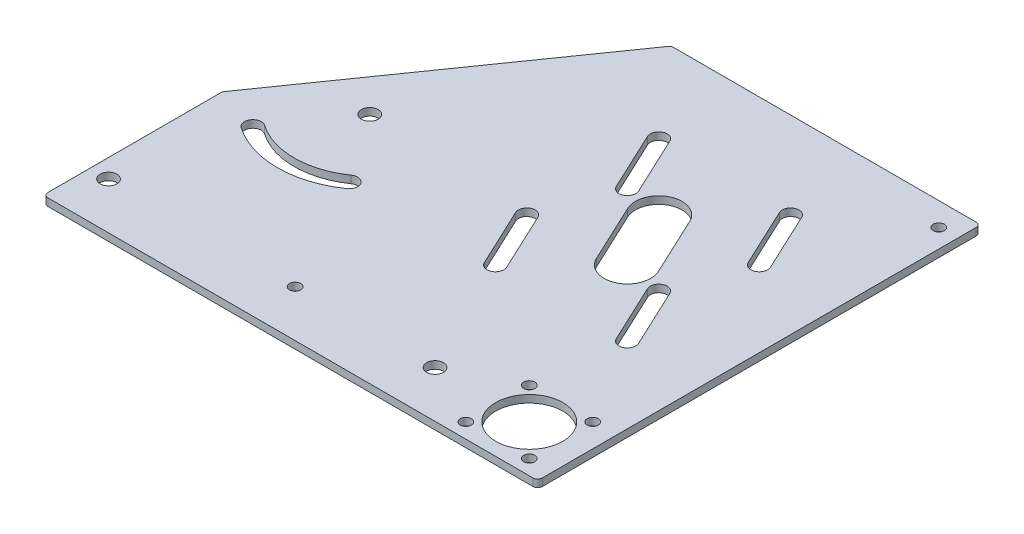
ISO-10303-21;
HEADER;
FILE_DESCRIPTION(('STEP AP214'),'2;1');
FILE_NAME('part.step','',(''),(''),'','','');
FILE_SCHEMA(('AUTOMOTIVE_DESIGN { 1 0 10303 214 1 1 1 1 }'));
ENDSEC;
DATA;
#1=APPLICATION_CONTEXT('core data for automotive mechanical design processes');
#2=APPLICATION_PROTOCOL_DEFINITION('international standard','automotive_design',2000,#1);
#3=PRODUCT_CONTEXT('',#1,'mechanical');
#4=PRODUCT('Part','Part','',(#3));
#5=PRODUCT_RELATED_PRODUCT_CATEGORY('part','',(#4));
#6=PRODUCT_DEFINITION_FORMATION('','',#4);
#7=PRODUCT_DEFINITION_CONTEXT('part definition',#1,'design');
#8=PRODUCT_DEFINITION('design','',#6,#7);
#9=PRODUCT_DEFINITION_SHAPE('','',#8);
#10=(LENGTH_UNIT() NAMED_UNIT(*) SI_UNIT(.MILLI.,.METRE.));
#11=(NAMED_UNIT(*) PLANE_ANGLE_UNIT() SI_UNIT($,.RADIAN.));
#12=(NAMED_UNIT(*) SI_UNIT($,.STERADIAN.) SOLID_ANGLE_UNIT());
#13=UNCERTAINTY_MEASURE_WITH_UNIT(LENGTH_MEASURE(1.E-05),#10,'distance_accuracy_value','');
#14=(GEOMETRIC_REPRESENTATION_CONTEXT(3) GLOBAL_UNCERTAINTY_ASSIGNED_CONTEXT((#13)) GLOBAL_UNIT_ASSIGNED_CONTEXT((#10,
#11,#12)) REPRESENTATION_CONTEXT('',''));
#15=CARTESIAN_POINT('',(0.,0.,0.));
#16=DIRECTION('',(0.,0.,1.));
#17=DIRECTION('',(1.,0.,0.));
#18=AXIS2_PLACEMENT_3D('',#15,#16,#17);
#19=CARTESIAN_POINT('',(141.29048736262,150.530192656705,29.7905046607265));
#20=DIRECTION('',(0.,-1.,0.));
#21=DIRECTION('',(0.,0.,-1.));
#22=AXIS2_PLACEMENT_3D('',#19,#20,#21);
#23=CYLINDRICAL_SURFACE('',#22,2.50000000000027);
#24=CARTESIAN_POINT('',(141.29048736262,150.530192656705,29.7905046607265));
#25=DIRECTION('',(0.,-1.,0.));
#26=DIRECTION('',(0.,0.,-1.));
#27=AXIS2_PLACEMENT_3D('',#24,#25,#26);
#28=CIRCLE('',#27,2.50000000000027);
#29=CARTESIAN_POINT('',(138.790487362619,150.530192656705,29.7905046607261));
#30=VERTEX_POINT('',#29);
#31=CARTESIAN_POINT('',(139.242607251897,150.530192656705,28.3565635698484));
#32=VERTEX_POINT('',#31);
#33=EDGE_CURVE('E18',#30,#32,#28,.T.);
#34=ORIENTED_EDGE('',*,*,#33,.T.);
#35=DIRECTION('',(0.,1.,0.));
#36=VECTOR('',#35,1.);
#37=CARTESIAN_POINT('',(139.242607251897,150.530192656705,28.3565635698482));
#38=LINE('',#37,#36);
#39=CARTESIAN_POINT('',(139.242607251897,146.530192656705,28.3565635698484));
#40=VERTEX_POINT('',#39);
#41=EDGE_CURVE('E238',#40,#32,#38,.T.);
#42=ORIENTED_EDGE('',*,*,#41,.F.);
#43=CARTESIAN_POINT('',(141.29048736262,146.530192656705,29.7905046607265));
#44=DIRECTION('',(0.,-1.,0.));
#45=DIRECTION('',(0.,0.,-1.));
#46=AXIS2_PLACEMENT_3D('',#43,#44,#45);
#47=CIRCLE('',#46,2.50000000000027);
#48=CARTESIAN_POINT('',(138.790487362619,146.530192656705,29.7905046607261));
#49=VERTEX_POINT('',#48);
#50=EDGE_CURVE('E243',#40,#49,#47,.F.);
#51=ORIENTED_EDGE('',*,*,#50,.T.);
#52=DIRECTION('',(0.,1.,0.));
#53=VECTOR('',#52,1.);
#54=CARTESIAN_POINT('',(138.790487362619,150.530192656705,29.7905046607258));
#55=LINE('',#54,#53);
#56=EDGE_CURVE('E241',#30,#49,#55,.F.);
#57=ORIENTED_EDGE('',*,*,#56,.F.);
#58=EDGE_LOOP('',(#34,#42,#51,#57));
#59=FACE_BOUND('',#58,.T.);
#60=ADVANCED_FACE('F15',(#59),#23,.T.);
#61=CARTESIAN_POINT('',(284.687519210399,146.530192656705,17.1351045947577));
#62=DIRECTION('',(0.,1.,0.));
#63=DIRECTION('',(0.,0.,1.));
#64=AXIS2_PLACEMENT_3D('',#61,#62,#63);
#65=PLANE('',#64);
#66=CARTESIAN_POINT('',(357.2904872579,146.530192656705,83.));
#67=DIRECTION('',(0.,-1.,0.));
#68=DIRECTION('',(0.,0.,-1.));
#69=AXIS2_PLACEMENT_3D('',#66,#67,#68);
#70=CIRCLE('',#69,3.);
#71=CARTESIAN_POINT('',(357.2904872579,146.530192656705,80.));
#72=VERTEX_POINT('',#71);
#73=EDGE_CURVE('E258',#72,#72,#70,.F.);
#74=ORIENTED_EDGE('',*,*,#73,.T.);
#75=EDGE_LOOP('',(#74));
#76=FACE_BOUND('',#75,.T.);
#77=CARTESIAN_POINT('',(391.2904872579,146.530192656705,83.));
#78=DIRECTION('',(0.,-1.,0.));
#79=DIRECTION('',(0.,0.,-1.));
#80=AXIS2_PLACEMENT_3D('',#77,#78,#79);
#81=CIRCLE('',#80,3.);
#82=CARTESIAN_POINT('',(391.2904872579,146.530192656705,80.));
#83=VERTEX_POINT('',#82);
#84=EDGE_CURVE('E263',#83,#83,#81,.F.);
#85=ORIENTED_EDGE('',*,*,#84,.T.);
#86=EDGE_LOOP('',(#85));
#87=FACE_BOUND('',#86,.T.);
#88=CARTESIAN_POINT('',(357.2904872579,146.530192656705,117.));
#89=DIRECTION('',(0.,-1.,0.));
#90=DIRECTION('',(0.,0.,-1.));
#91=AXIS2_PLACEMENT_3D('',#88,#89,#90);
#92=CIRCLE('',#91,3.);
#93=CARTESIAN_POINT('',(357.2904872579,146.530192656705,114.));
#94=VERTEX_POINT('',#93);
#95=EDGE_CURVE('E496',#94,#94,#92,.F.);
#96=ORIENTED_EDGE('',*,*,#95,.T.);
#97=EDGE_LOOP('',(#96));
#98=FACE_BOUND('',#97,.T.);
#99=CARTESIAN_POINT('',(391.2904872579,146.530192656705,117.));
#100=DIRECTION('',(0.,-1.,0.));
#101=DIRECTION('',(0.,0.,-1.));
#102=AXIS2_PLACEMENT_3D('',#99,#100,#101);
#103=CIRCLE('',#102,3.);
#104=CARTESIAN_POINT('',(391.2904872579,146.530192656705,114.));
#105=VERTEX_POINT('',#104);
#106=EDGE_CURVE('E499',#105,#105,#103,.F.);
#107=ORIENTED_EDGE('',*,*,#106,.T.);
#108=EDGE_LOOP('',(#107));
#109=FACE_BOUND('',#108,.T.);
#110=CARTESIAN_POINT('',(248.7904872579,146.530192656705,100.));
#111=DIRECTION('',(0.,-1.,0.));
#112=DIRECTION('',(0.,0.,-1.));
#113=AXIS2_PLACEMENT_3D('',#110,#111,#112);
#114=CIRCLE('',#113,3.);
#115=CARTESIAN_POINT('',(248.7904872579,146.530192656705,97.));
#116=VERTEX_POINT('',#115);
#117=EDGE_CURVE('E502',#116,#116,#114,.F.);
#118=ORIENTED_EDGE('',*,*,#117,.T.);
#119=EDGE_LOOP('',(#118));
#120=FACE_BOUND('',#119,.T.);
#121=CARTESIAN_POINT('',(393.7904872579,146.530192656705,-100.));
#122=DIRECTION('',(0.,-1.,0.));
#123=DIRECTION('',(0.,0.,-1.));
#124=AXIS2_PLACEMENT_3D('',#121,#122,#123);
#125=CIRCLE('',#124,3.);
#126=CARTESIAN_POINT('',(393.7904872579,146.530192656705,-103.));
#127=VERTEX_POINT('',#126);
#128=EDGE_CURVE('E505',#127,#127,#125,.F.);
#129=ORIENTED_EDGE('',*,*,#128,.T.);
#130=EDGE_LOOP('',(#129));
#131=FACE_BOUND('',#130,.T.);
#132=CARTESIAN_POINT('',(188.7904872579,146.530192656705,0.));
#133=DIRECTION('',(0.,-1.,0.));
#134=DIRECTION('',(0.,0.,-1.));
#135=AXIS2_PLACEMENT_3D('',#132,#133,#134);
#136=CIRCLE('',#135,4.5);
#137=CARTESIAN_POINT('',(188.7904872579,146.530192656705,-4.49999999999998));
#138=VERTEX_POINT('',#137);
#139=EDGE_CURVE('E508',#138,#138,#136,.F.);
#140=ORIENTED_EDGE('',*,*,#139,.T.);
#141=EDGE_LOOP('',(#140));
#142=FACE_BOUND('',#141,.T.);
#143=CARTESIAN_POINT('',(148.7904872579,146.530192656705,100.));
#144=DIRECTION('',(0.,-1.,0.));
#145=DIRECTION('',(0.,0.,-1.));
#146=AXIS2_PLACEMENT_3D('',#143,#144,#145);
#147=CIRCLE('',#146,4.5);
#148=CARTESIAN_POINT('',(148.7904872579,146.530192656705,95.5));
#149=VERTEX_POINT('',#148);
#150=EDGE_CURVE('E511',#149,#149,#147,.F.);
#151=ORIENTED_EDGE('',*,*,#150,.T.);
#152=EDGE_LOOP('',(#151));
#153=FACE_BOUND('',#152,.T.);
#154=CARTESIAN_POINT('',(323.7904872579,146.530192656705,100.));
#155=DIRECTION('',(0.,-1.,0.));
#156=DIRECTION('',(0.,0.,-1.));
#157=AXIS2_PLACEMENT_3D('',#154,#155,#156);
#158=CIRCLE('',#157,4.5);
#159=CARTESIAN_POINT('',(323.7904872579,146.530192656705,95.5));
#160=VERTEX_POINT('',#159);
#161=EDGE_CURVE('E514',#160,#160,#158,.F.);
#162=ORIENTED_EDGE('',*,*,#161,.T.);
#163=EDGE_LOOP('',(#162));
#164=FACE_BOUND('',#163,.T.);
#165=CARTESIAN_POINT('',(292.373326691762,146.530192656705,-34.5127739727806));
#166=DIRECTION('',(0.,-1.,0.));
#167=DIRECTION('',(0.,0.,-1.));
#168=AXIS2_PLACEMENT_3D('',#165,#166,#167);
#169=CIRCLE('',#168,4.5);
#170=CARTESIAN_POINT('',(288.300038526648,146.530192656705,-32.6000995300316));
#171=VERTEX_POINT('',#170);
#172=CARTESIAN_POINT('',(296.446614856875,146.530192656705,-36.4254484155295));
#173=VERTEX_POINT('',#172);
#174=EDGE_CURVE('E272',#171,#173,#169,.F.);
#175=ORIENTED_EDGE('',*,*,#174,.T.);
#176=DIRECTION('',(-0.425038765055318,0.,-0.905175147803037));
#177=VECTOR('',#176,1.);
#178=CARTESIAN_POINT('',(296.446614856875,146.530192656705,-36.4254484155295));
#179=LINE('',#178,#177);
#180=CARTESIAN_POINT('',(281.570258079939,146.530192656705,-68.1065785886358));
#181=VERTEX_POINT('',#180);
#182=EDGE_CURVE('E269',#173,#181,#179,.T.);
#183=ORIENTED_EDGE('',*,*,#182,.T.);
#184=CARTESIAN_POINT('',(277.496969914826,146.530192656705,-66.1939041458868));
#185=DIRECTION('',(0.,-1.,0.));
#186=DIRECTION('',(0.,0.,-1.));
#187=AXIS2_PLACEMENT_3D('',#184,#185,#186);
#188=CIRCLE('',#187,4.5);
#189=CARTESIAN_POINT('',(273.423681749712,146.530192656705,-64.2812297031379));
#190=VERTEX_POINT('',#189);
#191=EDGE_CURVE('E275',#181,#190,#188,.F.);
#192=ORIENTED_EDGE('',*,*,#191,.T.);
#193=DIRECTION('',(0.425038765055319,0.,0.905175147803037));
#194=VECTOR('',#193,1.);
#195=CARTESIAN_POINT('',(273.423681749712,146.530192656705,-64.2812297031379));
#196=LINE('',#195,#194);
#197=EDGE_CURVE('E278',#190,#171,#196,.T.);
#198=ORIENTED_EDGE('',*,*,#197,.T.);
#199=EDGE_LOOP('',(#175,#183,#192,#198));
#200=FACE_BOUND('',#199,.T.);
#201=CARTESIAN_POINT('',(277.493223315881,146.530192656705,4.51853324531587));
#202=DIRECTION('',(0.,-1.,0.));
#203=DIRECTION('',(0.,0.,-1.));
#204=AXIS2_PLACEMENT_3D('',#201,#202,#203);
#205=CIRCLE('',#204,4.5);
#206=CARTESIAN_POINT('',(281.566511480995,146.530192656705,2.60585880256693));
#207=VERTEX_POINT('',#206);
#208=CARTESIAN_POINT('',(273.419935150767,146.530192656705,6.43120768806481));
#209=VERTEX_POINT('',#208);
#210=EDGE_CURVE('E285',#207,#209,#205,.F.);
#211=ORIENTED_EDGE('',*,*,#210,.T.);
#212=DIRECTION('',(0.425038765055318,0.,0.905175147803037));
#213=VECTOR('',#212,1.);
#214=CARTESIAN_POINT('',(273.419935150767,146.530192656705,6.43120768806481));
#215=LINE('',#214,#213);
#216=CARTESIAN_POINT('',(288.296291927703,146.530192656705,38.1123378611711));
#217=VERTEX_POINT('',#216);
#218=EDGE_CURVE('E282',#209,#217,#215,.T.);
#219=ORIENTED_EDGE('',*,*,#218,.T.);
#220=CARTESIAN_POINT('',(292.369580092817,146.530192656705,36.1996634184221));
#221=DIRECTION('',(0.,-1.,0.));
#222=DIRECTION('',(0.,0.,-1.));
#223=AXIS2_PLACEMENT_3D('',#220,#221,#222);
#224=CIRCLE('',#223,4.50000000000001);
#225=CARTESIAN_POINT('',(296.442868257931,146.530192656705,34.2869889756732));
#226=VERTEX_POINT('',#225);
#227=EDGE_CURVE('E288',#217,#226,#224,.F.);
#228=ORIENTED_EDGE('',*,*,#227,.T.);
#229=DIRECTION('',(-0.425038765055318,0.,-0.905175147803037));
#230=VECTOR('',#229,1.);
#231=CARTESIAN_POINT('',(296.442868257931,146.530192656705,34.2869889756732));
#232=LINE('',#231,#230);
#233=EDGE_CURVE('E291',#226,#207,#232,.T.);
#234=ORIENTED_EDGE('',*,*,#233,.T.);
#235=EDGE_LOOP('',(#211,#219,#228,#234));
#236=FACE_BOUND('',#235,.T.);
#237=DIRECTION('',(0.425038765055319,0.,0.905175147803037));
#238=VECTOR('',#237,1.);
#239=CARTESIAN_POINT('',(344.134359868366,146.530192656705,-64.2812297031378));
#240=LINE('',#239,#238);
#241=CARTESIAN_POINT('',(344.134359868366,146.530192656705,-64.2812297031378));
#242=VERTEX_POINT('',#241);
#243=CARTESIAN_POINT('',(359.010716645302,146.530192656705,-32.6000995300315));
#244=VERTEX_POINT('',#243);
#245=EDGE_CURVE('E298',#242,#244,#240,.T.);
#246=ORIENTED_EDGE('',*,*,#245,.T.);
#247=CARTESIAN_POINT('',(363.084004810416,146.530192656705,-34.5127739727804));
#248=DIRECTION('',(0.,-1.,0.));
#249=DIRECTION('',(0.,0.,-1.));
#250=AXIS2_PLACEMENT_3D('',#247,#248,#249);
#251=CIRCLE('',#250,4.50000000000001);
#252=CARTESIAN_POINT('',(367.157292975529,146.530192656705,-36.4254484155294));
#253=VERTEX_POINT('',#252);
#254=EDGE_CURVE('E295',#244,#253,#251,.F.);
#255=ORIENTED_EDGE('',*,*,#254,.T.);
#256=DIRECTION('',(-0.425038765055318,0.,-0.905175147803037));
#257=VECTOR('',#256,1.);
#258=CARTESIAN_POINT('',(367.157292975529,146.530192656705,-36.4254484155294));
#259=LINE('',#258,#257);
#260=CARTESIAN_POINT('',(352.280936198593,146.530192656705,-68.1065785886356));
#261=VERTEX_POINT('',#260);
#262=EDGE_CURVE('E301',#253,#261,#259,.T.);
#263=ORIENTED_EDGE('',*,*,#262,.T.);
#264=CARTESIAN_POINT('',(348.20764803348,146.530192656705,-66.1939041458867));
#265=DIRECTION('',(0.,-1.,0.));
#266=DIRECTION('',(0.,0.,-1.));
#267=AXIS2_PLACEMENT_3D('',#264,#265,#266);
#268=CIRCLE('',#267,4.5);
#269=EDGE_CURVE('E304',#261,#242,#268,.F.);
#270=ORIENTED_EDGE('',*,*,#269,.T.);
#271=EDGE_LOOP('',(#246,#255,#263,#270));
#272=FACE_BOUND('',#271,.T.);
#273=DIRECTION('',(0.425038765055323,0.,0.905175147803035));
#274=VECTOR('',#273,1.);
#275=CARTESIAN_POINT('',(344.134359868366,146.530192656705,6.42944841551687));
#276=LINE('',#275,#274);
#277=CARTESIAN_POINT('',(344.134359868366,146.530192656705,6.42944841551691));
#278=VERTEX_POINT('',#277);
#279=CARTESIAN_POINT('',(359.010716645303,146.530192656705,38.1105785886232));
#280=VERTEX_POINT('',#279);
#281=EDGE_CURVE('E311',#278,#280,#276,.T.);
#282=ORIENTED_EDGE('',*,*,#281,.T.);
#283=CARTESIAN_POINT('',(363.084004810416,146.530192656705,36.1979041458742));
#284=DIRECTION('',(0.,-1.,0.));
#285=DIRECTION('',(0.,0.,-1.));
#286=AXIS2_PLACEMENT_3D('',#283,#284,#285);
#287=CIRCLE('',#286,4.5);
#288=CARTESIAN_POINT('',(367.15729297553,146.530192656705,34.2852297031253));
#289=VERTEX_POINT('',#288);
#290=EDGE_CURVE('E308',#280,#289,#287,.F.);
#291=ORIENTED_EDGE('',*,*,#290,.T.);
#292=DIRECTION('',(-0.425038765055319,0.,-0.905175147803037));
#293=VECTOR('',#292,1.);
#294=CARTESIAN_POINT('',(367.15729297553,146.530192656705,34.2852297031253));
#295=LINE('',#294,#293);
#296=CARTESIAN_POINT('',(352.280936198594,146.530192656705,2.60409953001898));
#297=VERTEX_POINT('',#296);
#298=EDGE_CURVE('E314',#289,#297,#295,.T.);
#299=ORIENTED_EDGE('',*,*,#298,.T.);
#300=CARTESIAN_POINT('',(348.20764803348,146.530192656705,4.51677397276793));
#301=DIRECTION('',(0.,-1.,0.));
#302=DIRECTION('',(0.,0.,-1.));
#303=AXIS2_PLACEMENT_3D('',#300,#301,#302);
#304=CIRCLE('',#303,4.50000000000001);
#305=EDGE_CURVE('E317',#297,#278,#304,.F.);
#306=ORIENTED_EDGE('',*,*,#305,.T.);
#307=EDGE_LOOP('',(#282,#291,#299,#306));
#308=FACE_BOUND('',#307,.T.);
#309=CARTESIAN_POINT('',(188.7904872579,146.530192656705,0.));
#310=DIRECTION('',(0.,-1.,0.));
#311=DIRECTION('',(0.,0.,-1.));
#312=AXIS2_PLACEMENT_3D('',#309,#310,#311);
#313=CIRCLE('',#312,40.5);
#314=CARTESIAN_POINT('',(165.560641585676,146.530192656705,33.1756577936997));
#315=VERTEX_POINT('',#314);
#316=CARTESIAN_POINT('',(212.020332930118,146.530192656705,33.175657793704));
#317=VERTEX_POINT('',#316);
#318=EDGE_CURVE('E322',#315,#317,#313,.F.);
#319=ORIENTED_EDGE('',*,*,#318,.F.);
#320=CARTESIAN_POINT('',(163.084558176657,146.530192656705,36.9353711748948));
#321=DIRECTION('',(0.,-1.,0.));
#322=DIRECTION('',(0.,0.,-1.));
#323=AXIS2_PLACEMENT_3D('',#320,#321,#322);
#324=CIRCLE('',#323,4.50182560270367);
#325=CARTESIAN_POINT('',(160.398453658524,146.530192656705,40.5480261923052));
#326=VERTEX_POINT('',#325);
#327=EDGE_CURVE('E327',#315,#326,#324,.F.);
#328=ORIENTED_EDGE('',*,*,#327,.T.);
#329=CARTESIAN_POINT('',(188.7904872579,146.530192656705,-7.993606E-13));
#330=DIRECTION('',(0.,-1.,0.));
#331=DIRECTION('',(0.,0.,-1.));
#332=AXIS2_PLACEMENT_3D('',#329,#330,#331);
#333=CIRCLE('',#332,49.5000000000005);
#334=CARTESIAN_POINT('',(217.182520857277,146.530192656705,40.548026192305));
#335=VERTEX_POINT('',#334);
#336=EDGE_CURVE('E328',#326,#335,#333,.F.);
#337=ORIENTED_EDGE('',*,*,#336,.T.);
#338=CARTESIAN_POINT('',(214.601426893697,146.530192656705,36.8618419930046));
#339=DIRECTION('',(0.,-1.,0.));
#340=DIRECTION('',(0.,0.,-1.));
#341=AXIS2_PLACEMENT_3D('',#338,#339,#340);
#342=CIRCLE('',#341,4.50000000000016);
#343=EDGE_CURVE('E331',#335,#317,#342,.F.);
#344=ORIENTED_EDGE('',*,*,#343,.T.);
#345=EDGE_LOOP('',(#319,#328,#337,#344));
#346=FACE_BOUND('',#345,.T.);
#347=CARTESIAN_POINT('',(374.2904872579,146.530192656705,100.));
#348=DIRECTION('',(0.,-1.,0.));
#349=DIRECTION('',(0.,0.,-1.));
#350=AXIS2_PLACEMENT_3D('',#347,#348,#349);
#351=CIRCLE('',#350,18.);
#352=CARTESIAN_POINT('',(374.2904872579,146.530192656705,82.));
#353=VERTEX_POINT('',#352);
#354=EDGE_CURVE('E392',#353,#353,#351,.F.);
#355=ORIENTED_EDGE('',*,*,#354,.T.);
#356=EDGE_LOOP('',(#355));
#357=FACE_BOUND('',#356,.T.);
#358=DIRECTION('',(0.425038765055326,0.,0.905175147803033));
#359=VECTOR('',#358,1.);
#360=CARTESIAN_POINT('',(301.537619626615,146.530192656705,-25.5255805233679));
#361=LINE('',#360,#359);
#362=CARTESIAN_POINT('',(301.537619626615,146.530192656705,-25.5255805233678));
#363=VERTEX_POINT('',#362);
#364=CARTESIAN_POINT('',(316.413976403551,146.530192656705,6.15554964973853));
#365=VERTEX_POINT('',#364);
#366=EDGE_CURVE('E338',#363,#365,#361,.T.);
#367=ORIENTED_EDGE('',*,*,#366,.T.);
#368=CARTESIAN_POINT('',(327.728665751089,146.530192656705,0.842565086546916));
#369=DIRECTION('',(0.,-1.,0.));
#370=DIRECTION('',(0.,0.,-1.));
#371=AXIS2_PLACEMENT_3D('',#368,#369,#370);
#372=CIRCLE('',#371,12.5);
#373=CARTESIAN_POINT('',(339.043355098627,146.530192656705,-4.47041947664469));
#374=VERTEX_POINT('',#373);
#375=EDGE_CURVE('E335',#365,#374,#372,.F.);
#376=ORIENTED_EDGE('',*,*,#375,.T.);
#377=DIRECTION('',(-0.425038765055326,0.,-0.905175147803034));
#378=VECTOR('',#377,1.);
#379=CARTESIAN_POINT('',(339.043355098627,146.530192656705,-4.47041947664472));
#380=LINE('',#379,#378);
#381=CARTESIAN_POINT('',(324.16699832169,146.530192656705,-36.1515496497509));
#382=VERTEX_POINT('',#381);
#383=EDGE_CURVE('E341',#374,#382,#380,.T.);
#384=ORIENTED_EDGE('',*,*,#383,.T.);
#385=CARTESIAN_POINT('',(312.852308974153,146.530192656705,-30.8385650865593));
#386=DIRECTION('',(0.,-1.,0.));
#387=DIRECTION('',(0.,0.,-1.));
#388=AXIS2_PLACEMENT_3D('',#385,#386,#387);
#389=CIRCLE('',#388,12.5);
#390=EDGE_CURVE('E344',#382,#363,#389,.F.);
#391=ORIENTED_EDGE('',*,*,#390,.T.);
#392=EDGE_LOOP('',(#367,#376,#384,#391));
#393=FACE_BOUND('',#392,.T.);
#394=DIRECTION('',(-0.573576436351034,0.,0.819152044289));
#395=VECTOR('',#394,1.);
#396=CARTESIAN_POINT('',(237.123571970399,146.530192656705,-111.431941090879));
#397=LINE('',#396,#395);
#398=CARTESIAN_POINT('',(237.123571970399,146.530192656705,-111.431941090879));
#399=VERTEX_POINT('',#398);
#400=EDGE_CURVE('E249',#399,#40,#397,.T.);
#401=ORIENTED_EDGE('',*,*,#400,.F.);
#402=CARTESIAN_POINT('',(239.171452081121,146.530192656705,-109.998000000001));
#403=DIRECTION('',(0.,-1.,0.));
#404=DIRECTION('',(0.,0.,-1.));
#405=AXIS2_PLACEMENT_3D('',#402,#403,#404);
#406=CIRCLE('',#405,2.49999999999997);
#407=CARTESIAN_POINT('',(239.171452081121,146.530192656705,-112.498000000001));
#408=VERTEX_POINT('',#407);
#409=EDGE_CURVE('E348',#408,#399,#406,.F.);
#410=ORIENTED_EDGE('',*,*,#409,.F.);
#411=DIRECTION('',(-1.,0.,0.));
#412=VECTOR('',#411,1.);
#413=CARTESIAN_POINT('',(401.290487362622,146.530192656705,-112.498000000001));
#414=LINE('',#413,#412);
#415=CARTESIAN_POINT('',(401.290487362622,146.530192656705,-112.498000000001));
#416=VERTEX_POINT('',#415);
#417=EDGE_CURVE('E354',#416,#408,#414,.T.);
#418=ORIENTED_EDGE('',*,*,#417,.F.);
#419=CARTESIAN_POINT('',(401.290487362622,146.530192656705,-109.998000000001));
#420=DIRECTION('',(0.,-1.,0.));
#421=DIRECTION('',(0.,0.,-1.));
#422=AXIS2_PLACEMENT_3D('',#419,#420,#421);
#423=CIRCLE('',#422,2.5);
#424=CARTESIAN_POINT('',(403.790487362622,146.530192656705,-109.998000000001));
#425=VERTEX_POINT('',#424);
#426=EDGE_CURVE('E358',#425,#416,#423,.F.);
#427=ORIENTED_EDGE('',*,*,#426,.F.);
#428=DIRECTION('',(0.,0.,-1.));
#429=VECTOR('',#428,1.);
#430=CARTESIAN_POINT('',(403.790487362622,146.530192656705,122.501999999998));
#431=LINE('',#430,#429);
#432=CARTESIAN_POINT('',(403.790487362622,146.530192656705,122.501999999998));
#433=VERTEX_POINT('',#432);
#434=EDGE_CURVE('E362',#433,#425,#431,.T.);
#435=ORIENTED_EDGE('',*,*,#434,.F.);
#436=CARTESIAN_POINT('',(401.290487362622,146.530192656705,122.501999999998));
#437=DIRECTION('',(0.,-1.,0.));
#438=DIRECTION('',(0.,0.,-1.));
#439=AXIS2_PLACEMENT_3D('',#436,#437,#438);
#440=CIRCLE('',#439,2.49999999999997);
#441=CARTESIAN_POINT('',(401.290487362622,146.530192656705,125.001999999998));
#442=VERTEX_POINT('',#441);
#443=EDGE_CURVE('E366',#442,#433,#440,.F.);
#444=ORIENTED_EDGE('',*,*,#443,.F.);
#445=DIRECTION('',(1.,0.,0.));
#446=VECTOR('',#445,1.);
#447=CARTESIAN_POINT('',(141.290487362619,146.530192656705,125.001999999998));
#448=LINE('',#447,#446);
#449=CARTESIAN_POINT('',(141.290487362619,146.530192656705,125.001999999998));
#450=VERTEX_POINT('',#449);
#451=EDGE_CURVE('E370',#450,#442,#448,.T.);
#452=ORIENTED_EDGE('',*,*,#451,.F.);
#453=CARTESIAN_POINT('',(141.29048736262,146.530192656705,122.501999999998));
#454=DIRECTION('',(0.,-1.,0.));
#455=DIRECTION('',(0.,0.,-1.));
#456=AXIS2_PLACEMENT_3D('',#453,#454,#455);
#457=CIRCLE('',#456,2.5000000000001);
#458=CARTESIAN_POINT('',(138.790487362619,146.530192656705,122.501999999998));
#459=VERTEX_POINT('',#458);
#460=EDGE_CURVE('E374',#459,#450,#457,.F.);
#461=ORIENTED_EDGE('',*,*,#460,.F.);
#462=DIRECTION('',(0.,0.,1.));
#463=VECTOR('',#462,1.);
#464=CARTESIAN_POINT('',(138.790487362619,146.530192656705,29.7905046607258));
#465=LINE('',#464,#463);
#466=EDGE_CURVE('E250',#49,#459,#465,.T.);
#467=ORIENTED_EDGE('',*,*,#466,.F.);
#468=ORIENTED_EDGE('',*,*,#50,.F.);
#469=EDGE_LOOP('',(#401,#410,#418,#427,#435,#444,#452,#461,#467,#468));
#470=FACE_BOUND('',#469,.T.);
#471=ADVANCED_FACE('F552',(#76,#87,#98,#109,#120,#131,#142,#153,#164,#200,#236,#272,#308,#346,
#357,#393,#470),#65,.F.);
#472=CARTESIAN_POINT('',(237.123571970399,150.530192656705,-111.431941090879));
#473=DIRECTION('',(-0.819152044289,0.,-0.573576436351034));
#474=DIRECTION('',(-0.573576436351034,0.,0.819152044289));
#475=AXIS2_PLACEMENT_3D('',#472,#473,#474);
#476=PLANE('',#475);
#477=DIRECTION('',(-0.573576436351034,0.,0.819152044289));
#478=VECTOR('',#477,1.);
#479=CARTESIAN_POINT('',(237.123571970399,150.530192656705,-111.431941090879));
#480=LINE('',#479,#478);
#481=CARTESIAN_POINT('',(237.123571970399,150.530192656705,-111.431941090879));
#482=VERTEX_POINT('',#481);
#483=EDGE_CURVE('E247',#482,#32,#480,.T.);
#484=ORIENTED_EDGE('',*,*,#483,.F.);
#485=DIRECTION('',(0.,-1.,0.));
#486=VECTOR('',#485,1.);
#487=CARTESIAN_POINT('',(237.123571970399,150.530192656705,-111.431941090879));
#488=LINE('',#487,#486);
#489=EDGE_CURVE('E345',#399,#482,#488,.F.);
#490=ORIENTED_EDGE('',*,*,#489,.F.);
#491=ORIENTED_EDGE('',*,*,#400,.T.);
#492=ORIENTED_EDGE('',*,*,#41,.T.);
#493=EDGE_LOOP('',(#484,#490,#491,#492));
#494=FACE_BOUND('',#493,.T.);
#495=ADVANCED_FACE('F245',(#494),#476,.T.);
#496=CARTESIAN_POINT('',(138.790487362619,150.530192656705,29.7905046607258));
#497=DIRECTION('',(-1.,0.,0.));
#498=DIRECTION('',(0.,0.,1.));
#499=AXIS2_PLACEMENT_3D('',#496,#497,#498);
#500=PLANE('',#499);
#501=DIRECTION('',(0.,0.,1.));
#502=VECTOR('',#501,1.);
#503=CARTESIAN_POINT('',(138.790487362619,150.530192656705,17.1351045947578));
#504=LINE('',#503,#502);
#505=CARTESIAN_POINT('',(138.790487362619,150.530192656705,122.501999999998));
#506=VERTEX_POINT('',#505);
#507=EDGE_CURVE('E257',#30,#506,#504,.T.);
#508=ORIENTED_EDGE('',*,*,#507,.F.);
#509=ORIENTED_EDGE('',*,*,#56,.T.);
#510=ORIENTED_EDGE('',*,*,#466,.T.);
#511=DIRECTION('',(0.,-1.,0.));
#512=VECTOR('',#511,1.);
#513=CARTESIAN_POINT('',(138.790487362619,150.530192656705,122.501999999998));
#514=LINE('',#513,#512);
#515=EDGE_CURVE('E371',#506,#459,#514,.T.);
#516=ORIENTED_EDGE('',*,*,#515,.F.);
#517=EDGE_LOOP('',(#508,#509,#510,#516));
#518=FACE_BOUND('',#517,.T.);
#519=ADVANCED_FACE('F554',(#518),#500,.T.);
#520=CARTESIAN_POINT('',(141.29048736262,150.530192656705,122.501999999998));
#521=DIRECTION('',(0.,-1.,0.));
#522=DIRECTION('',(0.,0.,-1.));
#523=AXIS2_PLACEMENT_3D('',#520,#521,#522);
#524=CYLINDRICAL_SURFACE('',#523,2.5000000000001);
#525=CARTESIAN_POINT('',(141.29048736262,150.530192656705,122.501999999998));
#526=DIRECTION('',(0.,-1.,0.));
#527=DIRECTION('',(0.,0.,-1.));
#528=AXIS2_PLACEMENT_3D('',#525,#526,#527);
#529=CIRCLE('',#528,2.5000000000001);
#530=CARTESIAN_POINT('',(141.290487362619,150.530192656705,125.001999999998));
#531=VERTEX_POINT('',#530);
#532=EDGE_CURVE('E260',#506,#531,#529,.F.);
#533=ORIENTED_EDGE('',*,*,#532,.F.);
#534=ORIENTED_EDGE('',*,*,#515,.T.);
#535=ORIENTED_EDGE('',*,*,#460,.T.);
#536=DIRECTION('',(0.,1.,0.));
#537=VECTOR('',#536,1.);
#538=CARTESIAN_POINT('',(141.290487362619,150.530192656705,125.001999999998));
#539=LINE('',#538,#537);
#540=EDGE_CURVE('E367',#531,#450,#539,.F.);
#541=ORIENTED_EDGE('',*,*,#540,.F.);
#542=EDGE_LOOP('',(#533,#534,#535,#541));
#543=FACE_BOUND('',#542,.T.);
#544=ADVANCED_FACE('F559',(#543),#524,.T.);
#545=CARTESIAN_POINT('',(141.290487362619,150.530192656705,125.001999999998));
#546=DIRECTION('',(0.,0.,1.));
#547=DIRECTION('',(1.,0.,0.));
#548=AXIS2_PLACEMENT_3D('',#545,#546,#547);
#549=PLANE('',#548);
#550=DIRECTION('',(1.,0.,0.));
#551=VECTOR('',#550,1.);
#552=CARTESIAN_POINT('',(284.687519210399,150.530192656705,125.001999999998));
#553=LINE('',#552,#551);
#554=CARTESIAN_POINT('',(401.290487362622,150.530192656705,125.001999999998));
#555=VERTEX_POINT('',#554);
#556=EDGE_CURVE('E491',#531,#555,#553,.T.);
#557=ORIENTED_EDGE('',*,*,#556,.F.);
#558=ORIENTED_EDGE('',*,*,#540,.T.);
#559=ORIENTED_EDGE('',*,*,#451,.T.);
#560=DIRECTION('',(0.,-1.,0.));
#561=VECTOR('',#560,1.);
#562=CARTESIAN_POINT('',(401.290487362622,150.530192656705,125.001999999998));
#563=LINE('',#562,#561);
#564=EDGE_CURVE('E363',#555,#442,#563,.T.);
#565=ORIENTED_EDGE('',*,*,#564,.F.);
#566=EDGE_LOOP('',(#557,#558,#559,#565));
#567=FACE_BOUND('',#566,.T.);
#568=ADVANCED_FACE('F561',(#567),#549,.T.);
#569=CARTESIAN_POINT('',(401.290487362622,150.530192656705,122.501999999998));
#570=DIRECTION('',(0.,-1.,0.));
#571=DIRECTION('',(0.,0.,-1.));
#572=AXIS2_PLACEMENT_3D('',#569,#570,#571);
#573=CYLINDRICAL_SURFACE('',#572,2.49999999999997);
#574=CARTESIAN_POINT('',(401.290487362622,150.530192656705,122.501999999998));
#575=DIRECTION('',(0.,-1.,0.));
#576=DIRECTION('',(0.,0.,-1.));
#577=AXIS2_PLACEMENT_3D('',#574,#575,#576);
#578=CIRCLE('',#577,2.49999999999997);
#579=CARTESIAN_POINT('',(403.790487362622,150.530192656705,122.501999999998));
#580=VERTEX_POINT('',#579);
#581=EDGE_CURVE('E488',#555,#580,#578,.F.);
#582=ORIENTED_EDGE('',*,*,#581,.F.);
#583=ORIENTED_EDGE('',*,*,#564,.T.);
#584=ORIENTED_EDGE('',*,*,#443,.T.);
#585=DIRECTION('',(0.,1.,0.));
#586=VECTOR('',#585,1.);
#587=CARTESIAN_POINT('',(403.790487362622,150.530192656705,122.501999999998));
#588=LINE('',#587,#586);
#589=EDGE_CURVE('E359',#580,#433,#588,.F.);
#590=ORIENTED_EDGE('',*,*,#589,.F.);
#591=EDGE_LOOP('',(#582,#583,#584,#590));
#592=FACE_BOUND('',#591,.T.);
#593=ADVANCED_FACE('F910',(#592),#573,.T.);
#594=CARTESIAN_POINT('',(403.790487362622,150.530192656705,122.501999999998));
#595=DIRECTION('',(1.,0.,0.));
#596=DIRECTION('',(0.,0.,-1.));
#597=AXIS2_PLACEMENT_3D('',#594,#595,#596);
#598=PLANE('',#597);
#599=DIRECTION('',(0.,0.,1.));
#600=VECTOR('',#599,1.);
#601=CARTESIAN_POINT('',(403.790487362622,150.530192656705,17.1351045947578));
#602=LINE('',#601,#600);
#603=CARTESIAN_POINT('',(403.790487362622,150.530192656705,-109.998000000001));
#604=VERTEX_POINT('',#603);
#605=EDGE_CURVE('E487',#580,#604,#602,.F.);
#606=ORIENTED_EDGE('',*,*,#605,.F.);
#607=ORIENTED_EDGE('',*,*,#589,.T.);
#608=ORIENTED_EDGE('',*,*,#434,.T.);
#609=DIRECTION('',(0.,-1.,0.));
#610=VECTOR('',#609,1.);
#611=CARTESIAN_POINT('',(403.790487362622,150.530192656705,-109.998000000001));
#612=LINE('',#611,#610);
#613=EDGE_CURVE('E355',#604,#425,#612,.T.);
#614=ORIENTED_EDGE('',*,*,#613,.F.);
#615=EDGE_LOOP('',(#606,#607,#608,#614));
#616=FACE_BOUND('',#615,.T.);
#617=ADVANCED_FACE('F902',(#616),#598,.T.);
#618=CARTESIAN_POINT('',(401.290487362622,150.530192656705,-109.998000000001));
#619=DIRECTION('',(0.,-1.,0.));
#620=DIRECTION('',(0.,0.,-1.));
#621=AXIS2_PLACEMENT_3D('',#618,#619,#620);
#622=CYLINDRICAL_SURFACE('',#621,2.5);
#623=CARTESIAN_POINT('',(401.290487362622,150.530192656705,-109.998000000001));
#624=DIRECTION('',(0.,-1.,0.));
#625=DIRECTION('',(0.,0.,-1.));
#626=AXIS2_PLACEMENT_3D('',#623,#624,#625);
#627=CIRCLE('',#626,2.5);
#628=CARTESIAN_POINT('',(401.290487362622,150.530192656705,-112.498000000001));
#629=VERTEX_POINT('',#628);
#630=EDGE_CURVE('E484',#604,#629,#627,.F.);
#631=ORIENTED_EDGE('',*,*,#630,.F.);
#632=ORIENTED_EDGE('',*,*,#613,.T.);
#633=ORIENTED_EDGE('',*,*,#426,.T.);
#634=DIRECTION('',(0.,1.,0.));
#635=VECTOR('',#634,1.);
#636=CARTESIAN_POINT('',(401.290487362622,150.530192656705,-112.498000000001));
#637=LINE('',#636,#635);
#638=EDGE_CURVE('E351',#629,#416,#637,.F.);
#639=ORIENTED_EDGE('',*,*,#638,.F.);
#640=EDGE_LOOP('',(#631,#632,#633,#639));
#641=FACE_BOUND('',#640,.T.);
#642=ADVANCED_FACE('F894',(#641),#622,.T.);
#643=CARTESIAN_POINT('',(401.290487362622,150.530192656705,-112.498000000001));
#644=DIRECTION('',(0.,0.,-1.));
#645=DIRECTION('',(-1.,0.,0.));
#646=AXIS2_PLACEMENT_3D('',#643,#644,#645);
#647=PLANE('',#646);
#648=DIRECTION('',(1.,0.,0.));
#649=VECTOR('',#648,1.);
#650=CARTESIAN_POINT('',(284.687519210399,150.530192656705,-112.498000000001));
#651=LINE('',#650,#649);
#652=CARTESIAN_POINT('',(239.171452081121,150.530192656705,-112.498000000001));
#653=VERTEX_POINT('',#652);
#654=EDGE_CURVE('E483',#629,#653,#651,.F.);
#655=ORIENTED_EDGE('',*,*,#654,.F.);
#656=ORIENTED_EDGE('',*,*,#638,.T.);
#657=ORIENTED_EDGE('',*,*,#417,.T.);
#658=DIRECTION('',(0.,-1.,0.));
#659=VECTOR('',#658,1.);
#660=CARTESIAN_POINT('',(239.171452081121,150.530192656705,-112.498000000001));
#661=LINE('',#660,#659);
#662=EDGE_CURVE('E347',#653,#408,#661,.T.);
#663=ORIENTED_EDGE('',*,*,#662,.F.);
#664=EDGE_LOOP('',(#655,#656,#657,#663));
#665=FACE_BOUND('',#664,.T.);
#666=ADVANCED_FACE('F886',(#665),#647,.T.);
#667=CARTESIAN_POINT('',(239.171452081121,150.530192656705,-109.998000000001));
#668=DIRECTION('',(0.,-1.,0.));
#669=DIRECTION('',(0.,0.,-1.));
#670=AXIS2_PLACEMENT_3D('',#667,#668,#669);
#671=CYLINDRICAL_SURFACE('',#670,2.49999999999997);
#672=CARTESIAN_POINT('',(239.171452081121,150.530192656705,-109.998000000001));
#673=DIRECTION('',(0.,-1.,0.));
#674=DIRECTION('',(0.,0.,-1.));
#675=AXIS2_PLACEMENT_3D('',#672,#673,#674);
#676=CIRCLE('',#675,2.49999999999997);
#677=EDGE_CURVE('E256',#653,#482,#676,.F.);
#678=ORIENTED_EDGE('',*,*,#677,.F.);
#679=ORIENTED_EDGE('',*,*,#662,.T.);
#680=ORIENTED_EDGE('',*,*,#409,.T.);
#681=ORIENTED_EDGE('',*,*,#489,.T.);
#682=EDGE_LOOP('',(#678,#679,#680,#681));
#683=FACE_BOUND('',#682,.T.);
#684=ADVANCED_FACE('F878',(#683),#671,.T.);
#685=CARTESIAN_POINT('',(312.852308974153,150.530192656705,-30.8385650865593));
#686=DIRECTION('',(0.,-1.,0.));
#687=DIRECTION('',(0.,0.,-1.));
#688=AXIS2_PLACEMENT_3D('',#685,#686,#687);
#689=CYLINDRICAL_SURFACE('',#688,12.5);
#690=DIRECTION('',(0.,1.,0.));
#691=VECTOR('',#690,1.);
#692=CARTESIAN_POINT('',(324.16699832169,150.530192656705,-36.151549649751));
#693=LINE('',#692,#691);
#694=CARTESIAN_POINT('',(324.16699832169,150.530192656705,-36.1515496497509));
#695=VERTEX_POINT('',#694);
#696=EDGE_CURVE('E342',#382,#695,#693,.T.);
#697=ORIENTED_EDGE('',*,*,#696,.T.);
#698=CARTESIAN_POINT('',(312.852308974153,150.530192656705,-30.8385650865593));
#699=DIRECTION('',(0.,-1.,0.));
#700=DIRECTION('',(0.,0.,-1.));
#701=AXIS2_PLACEMENT_3D('',#698,#699,#700);
#702=CIRCLE('',#701,12.5);
#703=CARTESIAN_POINT('',(301.537619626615,150.530192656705,-25.5255805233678));
#704=VERTEX_POINT('',#703);
#705=EDGE_CURVE('E479',#704,#695,#702,.T.);
#706=ORIENTED_EDGE('',*,*,#705,.F.);
#707=DIRECTION('',(0.,1.,0.));
#708=VECTOR('',#707,1.);
#709=CARTESIAN_POINT('',(301.537619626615,150.530192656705,-25.5255805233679));
#710=LINE('',#709,#708);
#711=EDGE_CURVE('E334',#704,#363,#710,.F.);
#712=ORIENTED_EDGE('',*,*,#711,.T.);
#713=ORIENTED_EDGE('',*,*,#390,.F.);
#714=EDGE_LOOP('',(#697,#706,#712,#713));
#715=FACE_BOUND('',#714,.T.);
#716=ADVANCED_FACE('F870',(#715),#689,.F.);
#717=CARTESIAN_POINT('',(339.043355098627,150.530192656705,-4.47041947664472));
#718=DIRECTION('',(0.905175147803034,0.,-0.425038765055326));
#719=DIRECTION('',(-0.425038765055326,0.,-0.905175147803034));
#720=AXIS2_PLACEMENT_3D('',#717,#718,#719);
#721=PLANE('',#720);
#722=DIRECTION('',(0.,-1.,0.));
#723=VECTOR('',#722,1.);
#724=CARTESIAN_POINT('',(339.043355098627,150.530192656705,-4.47041947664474));
#725=LINE('',#724,#723);
#726=CARTESIAN_POINT('',(339.043355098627,150.530192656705,-4.47041947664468));
#727=VERTEX_POINT('',#726);
#728=EDGE_CURVE('E339',#374,#727,#725,.F.);
#729=ORIENTED_EDGE('',*,*,#728,.T.);
#730=DIRECTION('',(0.425038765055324,0.,0.905175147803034));
#731=VECTOR('',#730,1.);
#732=CARTESIAN_POINT('',(324.16699832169,150.530192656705,-36.151549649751));
#733=LINE('',#732,#731);
#734=EDGE_CURVE('E478',#695,#727,#733,.T.);
#735=ORIENTED_EDGE('',*,*,#734,.F.);
#736=ORIENTED_EDGE('',*,*,#696,.F.);
#737=ORIENTED_EDGE('',*,*,#383,.F.);
#738=EDGE_LOOP('',(#729,#735,#736,#737));
#739=FACE_BOUND('',#738,.T.);
#740=ADVANCED_FACE('F862',(#739),#721,.F.);
#741=CARTESIAN_POINT('',(327.728665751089,150.530192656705,0.842565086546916));
#742=DIRECTION('',(0.,-1.,0.));
#743=DIRECTION('',(0.,0.,-1.));
#744=AXIS2_PLACEMENT_3D('',#741,#742,#743);
#745=CYLINDRICAL_SURFACE('',#744,12.5);
#746=DIRECTION('',(0.,1.,0.));
#747=VECTOR('',#746,1.);
#748=CARTESIAN_POINT('',(316.413976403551,150.530192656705,6.15554964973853));
#749=LINE('',#748,#747);
#750=CARTESIAN_POINT('',(316.413976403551,150.530192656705,6.15554964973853));
#751=VERTEX_POINT('',#750);
#752=EDGE_CURVE('E332',#365,#751,#749,.T.);
#753=ORIENTED_EDGE('',*,*,#752,.T.);
#754=CARTESIAN_POINT('',(327.728665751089,150.530192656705,0.842565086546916));
#755=DIRECTION('',(0.,-1.,0.));
#756=DIRECTION('',(0.,0.,-1.));
#757=AXIS2_PLACEMENT_3D('',#754,#755,#756);
#758=CIRCLE('',#757,12.5);
#759=EDGE_CURVE('E475',#727,#751,#758,.T.);
#760=ORIENTED_EDGE('',*,*,#759,.F.);
#761=ORIENTED_EDGE('',*,*,#728,.F.);
#762=ORIENTED_EDGE('',*,*,#375,.F.);
#763=EDGE_LOOP('',(#753,#760,#761,#762));
#764=FACE_BOUND('',#763,.T.);
#765=ADVANCED_FACE('F854',(#764),#745,.F.);
#766=CARTESIAN_POINT('',(301.537619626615,150.530192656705,-25.5255805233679));
#767=DIRECTION('',(-0.905175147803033,0.,0.425038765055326));
#768=DIRECTION('',(0.425038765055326,0.,0.905175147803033));
#769=AXIS2_PLACEMENT_3D('',#766,#767,#768);
#770=PLANE('',#769);
#771=ORIENTED_EDGE('',*,*,#711,.F.);
#772=DIRECTION('',(-0.425038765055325,0.,-0.905175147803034));
#773=VECTOR('',#772,1.);
#774=CARTESIAN_POINT('',(316.413976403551,150.530192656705,6.15554964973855));
#775=LINE('',#774,#773);
#776=EDGE_CURVE('E474',#751,#704,#775,.T.);
#777=ORIENTED_EDGE('',*,*,#776,.F.);
#778=ORIENTED_EDGE('',*,*,#752,.F.);
#779=ORIENTED_EDGE('',*,*,#366,.F.);
#780=EDGE_LOOP('',(#771,#777,#778,#779));
#781=FACE_BOUND('',#780,.T.);
#782=ADVANCED_FACE('F846',(#781),#770,.F.);
#783=CARTESIAN_POINT('',(374.2904872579,150.530192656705,100.));
#784=DIRECTION('',(0.,-1.,0.));
#785=DIRECTION('',(0.,0.,-1.));
#786=AXIS2_PLACEMENT_3D('',#783,#784,#785);
#787=CYLINDRICAL_SURFACE('',#786,18.);
#788=CARTESIAN_POINT('',(374.2904872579,150.530192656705,100.));
#789=DIRECTION('',(0.,-1.,0.));
#790=DIRECTION('',(0.,0.,-1.));
#791=AXIS2_PLACEMENT_3D('',#788,#789,#790);
#792=CIRCLE('',#791,18.);
#793=CARTESIAN_POINT('',(374.2904872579,150.530192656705,82.));
#794=VERTEX_POINT('',#793);
#795=EDGE_CURVE('E471',#794,#794,#792,.T.);
#796=ORIENTED_EDGE('',*,*,#795,.F.);
#797=EDGE_LOOP('',(#796));
#798=FACE_BOUND('',#797,.T.);
#799=ORIENTED_EDGE('',*,*,#354,.F.);
#800=EDGE_LOOP('',(#799));
#801=FACE_BOUND('',#800,.T.);
#802=ADVANCED_FACE('F838',(#798,#801),#787,.F.);
#803=CARTESIAN_POINT('',(214.601426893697,150.530192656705,36.8618419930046));
#804=DIRECTION('',(0.,-1.,0.));
#805=DIRECTION('',(0.,0.,-1.));
#806=AXIS2_PLACEMENT_3D('',#803,#804,#805);
#807=CYLINDRICAL_SURFACE('',#806,4.50000000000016);
#808=DIRECTION('',(0.,-1.,0.));
#809=VECTOR('',#808,1.);
#810=CARTESIAN_POINT('',(217.182520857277,150.530192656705,40.5480261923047));
#811=LINE('',#810,#809);
#812=CARTESIAN_POINT('',(217.182520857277,150.530192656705,40.5480261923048));
#813=VERTEX_POINT('',#812);
#814=EDGE_CURVE('E329',#335,#813,#811,.F.);
#815=ORIENTED_EDGE('',*,*,#814,.T.);
#816=CARTESIAN_POINT('',(214.601426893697,150.530192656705,36.8618419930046));
#817=DIRECTION('',(0.,-1.,0.));
#818=DIRECTION('',(0.,0.,-1.));
#819=AXIS2_PLACEMENT_3D('',#816,#817,#818);
#820=CIRCLE('',#819,4.50000000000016);
#821=CARTESIAN_POINT('',(212.020332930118,150.530192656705,33.175657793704));
#822=VERTEX_POINT('',#821);
#823=EDGE_CURVE('E468',#822,#813,#820,.T.);
#824=ORIENTED_EDGE('',*,*,#823,.F.);
#825=DIRECTION('',(0.,-1.,0.));
#826=VECTOR('',#825,1.);
#827=CARTESIAN_POINT('',(212.020332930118,150.530192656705,33.1756577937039));
#828=LINE('',#827,#826);
#829=EDGE_CURVE('E318',#317,#822,#828,.F.);
#830=ORIENTED_EDGE('',*,*,#829,.F.);
#831=ORIENTED_EDGE('',*,*,#343,.F.);
#832=EDGE_LOOP('',(#815,#824,#830,#831));
#833=FACE_BOUND('',#832,.T.);
#834=ADVANCED_FACE('F830',(#833),#807,.F.);
#835=CARTESIAN_POINT('',(188.7904872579,150.530192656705,-7.993606E-13));
#836=DIRECTION('',(0.,-1.,0.));
#837=DIRECTION('',(0.,0.,-1.));
#838=AXIS2_PLACEMENT_3D('',#835,#836,#837);
#839=CYLINDRICAL_SURFACE('',#838,49.5000000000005);
#840=DIRECTION('',(0.,-1.,0.));
#841=VECTOR('',#840,1.);
#842=CARTESIAN_POINT('',(160.398453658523,150.530192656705,40.5480261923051));
#843=LINE('',#842,#841);
#844=CARTESIAN_POINT('',(160.398453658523,150.530192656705,40.548026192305));
#845=VERTEX_POINT('',#844);
#846=EDGE_CURVE('E325',#326,#845,#843,.F.);
#847=ORIENTED_EDGE('',*,*,#846,.T.);
#848=CARTESIAN_POINT('',(188.7904872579,150.530192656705,-7.993606E-13));
#849=DIRECTION('',(0.,-1.,0.));
#850=DIRECTION('',(0.,0.,-1.));
#851=AXIS2_PLACEMENT_3D('',#848,#849,#850);
#852=CIRCLE('',#851,49.5000000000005);
#853=EDGE_CURVE('E465',#813,#845,#852,.T.);
#854=ORIENTED_EDGE('',*,*,#853,.F.);
#855=ORIENTED_EDGE('',*,*,#814,.F.);
#856=ORIENTED_EDGE('',*,*,#336,.F.);
#857=EDGE_LOOP('',(#847,#854,#855,#856));
#858=FACE_BOUND('',#857,.T.);
#859=ADVANCED_FACE('F822',(#858),#839,.F.);
#860=CARTESIAN_POINT('',(163.084558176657,150.530192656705,36.9353711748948));
#861=DIRECTION('',(0.,-1.,0.));
#862=DIRECTION('',(0.,0.,-1.));
#863=AXIS2_PLACEMENT_3D('',#860,#861,#862);
#864=CYLINDRICAL_SURFACE('',#863,4.50182560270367);
#865=DIRECTION('',(0.,-1.,0.));
#866=VECTOR('',#865,1.);
#867=CARTESIAN_POINT('',(165.560641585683,150.530192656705,33.1756577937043));
#868=LINE('',#867,#866);
#869=CARTESIAN_POINT('',(165.560641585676,150.530192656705,33.1756577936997));
#870=VERTEX_POINT('',#869);
#871=EDGE_CURVE('E321',#870,#315,#868,.T.);
#872=ORIENTED_EDGE('',*,*,#871,.F.);
#873=CARTESIAN_POINT('',(163.084558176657,150.530192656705,36.9353711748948));
#874=DIRECTION('',(0.,-1.,0.));
#875=DIRECTION('',(0.,0.,-1.));
#876=AXIS2_PLACEMENT_3D('',#873,#874,#875);
#877=CIRCLE('',#876,4.50182560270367);
#878=EDGE_CURVE('E462',#845,#870,#877,.T.);
#879=ORIENTED_EDGE('',*,*,#878,.F.);
#880=ORIENTED_EDGE('',*,*,#846,.F.);
#881=ORIENTED_EDGE('',*,*,#327,.F.);
#882=EDGE_LOOP('',(#872,#879,#880,#881));
#883=FACE_BOUND('',#882,.T.);
#884=ADVANCED_FACE('F814',(#883),#864,.F.);
#885=CARTESIAN_POINT('',(188.7904872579,150.530192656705,0.));
#886=DIRECTION('',(0.,-1.,0.));
#887=DIRECTION('',(0.,0.,-1.));
#888=AXIS2_PLACEMENT_3D('',#885,#886,#887);
#889=CYLINDRICAL_SURFACE('',#888,40.5);
#890=CARTESIAN_POINT('',(188.7904872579,150.530192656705,0.));
#891=DIRECTION('',(0.,-1.,0.));
#892=DIRECTION('',(0.,0.,-1.));
#893=AXIS2_PLACEMENT_3D('',#890,#891,#892);
#894=CIRCLE('',#893,40.5);
#895=EDGE_CURVE('E459',#870,#822,#894,.F.);
#896=ORIENTED_EDGE('',*,*,#895,.F.);
#897=ORIENTED_EDGE('',*,*,#871,.T.);
#898=ORIENTED_EDGE('',*,*,#318,.T.);
#899=ORIENTED_EDGE('',*,*,#829,.T.);
#900=EDGE_LOOP('',(#896,#897,#898,#899));
#901=FACE_BOUND('',#900,.T.);
#902=ADVANCED_FACE('F806',(#901),#889,.T.);
#903=CARTESIAN_POINT('',(348.20764803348,150.530192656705,4.51677397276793));
#904=DIRECTION('',(0.,-1.,0.));
#905=DIRECTION('',(0.,0.,-1.));
#906=AXIS2_PLACEMENT_3D('',#903,#904,#905);
#907=CYLINDRICAL_SURFACE('',#906,4.50000000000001);
#908=DIRECTION('',(0.,1.,0.));
#909=VECTOR('',#908,1.);
#910=CARTESIAN_POINT('',(352.280936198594,150.530192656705,2.60409953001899));
#911=LINE('',#910,#909);
#912=CARTESIAN_POINT('',(352.280936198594,150.530192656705,2.60409953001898));
#913=VERTEX_POINT('',#912);
#914=EDGE_CURVE('E315',#297,#913,#911,.T.);
#915=ORIENTED_EDGE('',*,*,#914,.T.);
#916=CARTESIAN_POINT('',(348.20764803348,150.530192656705,4.51677397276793));
#917=DIRECTION('',(0.,-1.,0.));
#918=DIRECTION('',(0.,0.,-1.));
#919=AXIS2_PLACEMENT_3D('',#916,#917,#918);
#920=CIRCLE('',#919,4.50000000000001);
#921=CARTESIAN_POINT('',(344.134359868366,150.530192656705,6.42944841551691));
#922=VERTEX_POINT('',#921);
#923=EDGE_CURVE('E456',#922,#913,#920,.T.);
#924=ORIENTED_EDGE('',*,*,#923,.F.);
#925=DIRECTION('',(0.,1.,0.));
#926=VECTOR('',#925,1.);
#927=CARTESIAN_POINT('',(344.134359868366,150.530192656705,6.42944841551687));
#928=LINE('',#927,#926);
#929=EDGE_CURVE('E307',#922,#278,#928,.F.);
#930=ORIENTED_EDGE('',*,*,#929,.T.);
#931=ORIENTED_EDGE('',*,*,#305,.F.);
#932=EDGE_LOOP('',(#915,#924,#930,#931));
#933=FACE_BOUND('',#932,.T.);
#934=ADVANCED_FACE('F798',(#933),#907,.F.);
#935=CARTESIAN_POINT('',(367.15729297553,150.530192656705,34.2852297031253));
#936=DIRECTION('',(0.905175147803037,0.,-0.425038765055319));
#937=DIRECTION('',(-0.425038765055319,0.,-0.905175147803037));
#938=AXIS2_PLACEMENT_3D('',#935,#936,#937);
#939=PLANE('',#938);
#940=DIRECTION('',(0.,-1.,0.));
#941=VECTOR('',#940,1.);
#942=CARTESIAN_POINT('',(367.15729297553,150.530192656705,34.2852297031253));
#943=LINE('',#942,#941);
#944=CARTESIAN_POINT('',(367.15729297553,150.530192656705,34.2852297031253));
#945=VERTEX_POINT('',#944);
#946=EDGE_CURVE('E312',#289,#945,#943,.F.);
#947=ORIENTED_EDGE('',*,*,#946,.T.);
#948=DIRECTION('',(0.425038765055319,0.,0.905175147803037));
#949=VECTOR('',#948,1.);
#950=CARTESIAN_POINT('',(352.280936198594,150.530192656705,2.60409953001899));
#951=LINE('',#950,#949);
#952=EDGE_CURVE('E455',#913,#945,#951,.T.);
#953=ORIENTED_EDGE('',*,*,#952,.F.);
#954=ORIENTED_EDGE('',*,*,#914,.F.);
#955=ORIENTED_EDGE('',*,*,#298,.F.);
#956=EDGE_LOOP('',(#947,#953,#954,#955));
#957=FACE_BOUND('',#956,.T.);
#958=ADVANCED_FACE('F790',(#957),#939,.F.);
#959=CARTESIAN_POINT('',(363.084004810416,150.530192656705,36.1979041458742));
#960=DIRECTION('',(0.,-1.,0.));
#961=DIRECTION('',(0.,0.,-1.));
#962=AXIS2_PLACEMENT_3D('',#959,#960,#961);
#963=CYLINDRICAL_SURFACE('',#962,4.5);
#964=DIRECTION('',(0.,1.,0.));
#965=VECTOR('',#964,1.);
#966=CARTESIAN_POINT('',(359.010716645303,150.530192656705,38.1105785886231));
#967=LINE('',#966,#965);
#968=CARTESIAN_POINT('',(359.010716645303,150.530192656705,38.1105785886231));
#969=VERTEX_POINT('',#968);
#970=EDGE_CURVE('E305',#280,#969,#967,.T.);
#971=ORIENTED_EDGE('',*,*,#970,.T.);
#972=CARTESIAN_POINT('',(363.084004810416,150.530192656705,36.1979041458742));
#973=DIRECTION('',(0.,-1.,0.));
#974=DIRECTION('',(0.,0.,-1.));
#975=AXIS2_PLACEMENT_3D('',#972,#973,#974);
#976=CIRCLE('',#975,4.5);
#977=EDGE_CURVE('E452',#945,#969,#976,.T.);
#978=ORIENTED_EDGE('',*,*,#977,.F.);
#979=ORIENTED_EDGE('',*,*,#946,.F.);
#980=ORIENTED_EDGE('',*,*,#290,.F.);
#981=EDGE_LOOP('',(#971,#978,#979,#980));
#982=FACE_BOUND('',#981,.T.);
#983=ADVANCED_FACE('F782',(#982),#963,.F.);
#984=CARTESIAN_POINT('',(344.134359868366,150.530192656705,6.42944841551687));
#985=DIRECTION('',(-0.905175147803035,0.,0.425038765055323));
#986=DIRECTION('',(0.425038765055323,0.,0.905175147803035));
#987=AXIS2_PLACEMENT_3D('',#984,#985,#986);
#988=PLANE('',#987);
#989=ORIENTED_EDGE('',*,*,#929,.F.);
#990=DIRECTION('',(-0.425038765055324,0.,-0.905175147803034));
#991=VECTOR('',#990,1.);
#992=CARTESIAN_POINT('',(359.010716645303,150.530192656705,38.1105785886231));
#993=LINE('',#992,#991);
#994=EDGE_CURVE('E451',#969,#922,#993,.T.);
#995=ORIENTED_EDGE('',*,*,#994,.F.);
#996=ORIENTED_EDGE('',*,*,#970,.F.);
#997=ORIENTED_EDGE('',*,*,#281,.F.);
#998=EDGE_LOOP('',(#989,#995,#996,#997));
#999=FACE_BOUND('',#998,.T.);
#1000=ADVANCED_FACE('F774',(#999),#988,.F.);
#1001=CARTESIAN_POINT('',(348.20764803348,150.530192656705,-66.1939041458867));
#1002=DIRECTION('',(0.,-1.,0.));
#1003=DIRECTION('',(0.,0.,-1.));
#1004=AXIS2_PLACEMENT_3D('',#1001,#1002,#1003);
#1005=CYLINDRICAL_SURFACE('',#1004,4.5);
#1006=DIRECTION('',(0.,1.,0.));
#1007=VECTOR('',#1006,1.);
#1008=CARTESIAN_POINT('',(352.280936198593,150.530192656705,-68.1065785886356));
#1009=LINE('',#1008,#1007);
#1010=CARTESIAN_POINT('',(352.280936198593,150.530192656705,-68.1065785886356));
#1011=VERTEX_POINT('',#1010);
#1012=EDGE_CURVE('E302',#261,#1011,#1009,.T.);
#1013=ORIENTED_EDGE('',*,*,#1012,.T.);
#1014=CARTESIAN_POINT('',(348.20764803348,150.530192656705,-66.1939041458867));
#1015=DIRECTION('',(0.,-1.,0.));
#1016=DIRECTION('',(0.,0.,-1.));
#1017=AXIS2_PLACEMENT_3D('',#1014,#1015,#1016);
#1018=CIRCLE('',#1017,4.5);
#1019=CARTESIAN_POINT('',(344.134359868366,150.530192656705,-64.2812297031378));
#1020=VERTEX_POINT('',#1019);
#1021=EDGE_CURVE('E448',#1020,#1011,#1018,.T.);
#1022=ORIENTED_EDGE('',*,*,#1021,.F.);
#1023=DIRECTION('',(0.,1.,0.));
#1024=VECTOR('',#1023,1.);
#1025=CARTESIAN_POINT('',(344.134359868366,150.530192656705,-64.2812297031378));
#1026=LINE('',#1025,#1024);
#1027=EDGE_CURVE('E294',#1020,#242,#1026,.F.);
#1028=ORIENTED_EDGE('',*,*,#1027,.T.);
#1029=ORIENTED_EDGE('',*,*,#269,.F.);
#1030=EDGE_LOOP('',(#1013,#1022,#1028,#1029));
#1031=FACE_BOUND('',#1030,.T.);
#1032=ADVANCED_FACE('F766',(#1031),#1005,.F.);
#1033=CARTESIAN_POINT('',(367.157292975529,150.530192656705,-36.4254484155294));
#1034=DIRECTION('',(0.905175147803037,0.,-0.425038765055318));
#1035=DIRECTION('',(-0.425038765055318,0.,-0.905175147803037));
#1036=AXIS2_PLACEMENT_3D('',#1033,#1034,#1035);
#1037=PLANE('',#1036);
#1038=DIRECTION('',(0.,-1.,0.));
#1039=VECTOR('',#1038,1.);
#1040=CARTESIAN_POINT('',(367.157292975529,150.530192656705,-36.4254484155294));
#1041=LINE('',#1040,#1039);
#1042=CARTESIAN_POINT('',(367.157292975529,150.530192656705,-36.4254484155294));
#1043=VERTEX_POINT('',#1042);
#1044=EDGE_CURVE('E299',#253,#1043,#1041,.F.);
#1045=ORIENTED_EDGE('',*,*,#1044,.T.);
#1046=DIRECTION('',(0.425038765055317,0.,0.905175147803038));
#1047=VECTOR('',#1046,1.);
#1048=CARTESIAN_POINT('',(352.280936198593,150.530192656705,-68.1065785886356));
#1049=LINE('',#1048,#1047);
#1050=EDGE_CURVE('E447',#1011,#1043,#1049,.T.);
#1051=ORIENTED_EDGE('',*,*,#1050,.F.);
#1052=ORIENTED_EDGE('',*,*,#1012,.F.);
#1053=ORIENTED_EDGE('',*,*,#262,.F.);
#1054=EDGE_LOOP('',(#1045,#1051,#1052,#1053));
#1055=FACE_BOUND('',#1054,.T.);
#1056=ADVANCED_FACE('F758',(#1055),#1037,.F.);
#1057=CARTESIAN_POINT('',(363.084004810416,150.530192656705,-34.5127739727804));
#1058=DIRECTION('',(0.,-1.,0.));
#1059=DIRECTION('',(0.,0.,-1.));
#1060=AXIS2_PLACEMENT_3D('',#1057,#1058,#1059);
#1061=CYLINDRICAL_SURFACE('',#1060,4.50000000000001);
#1062=DIRECTION('',(0.,1.,0.));
#1063=VECTOR('',#1062,1.);
#1064=CARTESIAN_POINT('',(359.010716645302,150.530192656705,-32.6000995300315));
#1065=LINE('',#1064,#1063);
#1066=CARTESIAN_POINT('',(359.010716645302,150.530192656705,-32.6000995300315));
#1067=VERTEX_POINT('',#1066);
#1068=EDGE_CURVE('E292',#244,#1067,#1065,.T.);
#1069=ORIENTED_EDGE('',*,*,#1068,.T.);
#1070=CARTESIAN_POINT('',(363.084004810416,150.530192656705,-34.5127739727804));
#1071=DIRECTION('',(0.,-1.,0.));
#1072=DIRECTION('',(0.,0.,-1.));
#1073=AXIS2_PLACEMENT_3D('',#1070,#1071,#1072);
#1074=CIRCLE('',#1073,4.50000000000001);
#1075=EDGE_CURVE('E443',#1043,#1067,#1074,.T.);
#1076=ORIENTED_EDGE('',*,*,#1075,.F.);
#1077=ORIENTED_EDGE('',*,*,#1044,.F.);
#1078=ORIENTED_EDGE('',*,*,#254,.F.);
#1079=EDGE_LOOP('',(#1069,#1076,#1077,#1078));
#1080=FACE_BOUND('',#1079,.T.);
#1081=ADVANCED_FACE('F750',(#1080),#1061,.F.);
#1082=CARTESIAN_POINT('',(344.134359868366,150.530192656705,-64.2812297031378));
#1083=DIRECTION('',(-0.905175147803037,0.,0.425038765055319));
#1084=DIRECTION('',(0.425038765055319,0.,0.905175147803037));
#1085=AXIS2_PLACEMENT_3D('',#1082,#1083,#1084);
#1086=PLANE('',#1085);
#1087=ORIENTED_EDGE('',*,*,#1027,.F.);
#1088=DIRECTION('',(-0.42503876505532,0.,-0.905175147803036));
#1089=VECTOR('',#1088,1.);
#1090=CARTESIAN_POINT('',(359.010716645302,150.530192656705,-32.6000995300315));
#1091=LINE('',#1090,#1089);
#1092=EDGE_CURVE('E446',#1067,#1020,#1091,.T.);
#1093=ORIENTED_EDGE('',*,*,#1092,.F.);
#1094=ORIENTED_EDGE('',*,*,#1068,.F.);
#1095=ORIENTED_EDGE('',*,*,#245,.F.);
#1096=EDGE_LOOP('',(#1087,#1093,#1094,#1095));
#1097=FACE_BOUND('',#1096,.T.);
#1098=ADVANCED_FACE('F742',(#1097),#1086,.F.);
#1099=CARTESIAN_POINT('',(296.442868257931,150.530192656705,34.2869889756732));
#1100=DIRECTION('',(0.905175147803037,0.,-0.425038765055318));
#1101=DIRECTION('',(-0.425038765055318,0.,-0.905175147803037));
#1102=AXIS2_PLACEMENT_3D('',#1099,#1100,#1101);
#1103=PLANE('',#1102);
#1104=DIRECTION('',(0.,-1.,0.));
#1105=VECTOR('',#1104,1.);
#1106=CARTESIAN_POINT('',(296.442868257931,150.530192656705,34.2869889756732));
#1107=LINE('',#1106,#1105);
#1108=CARTESIAN_POINT('',(296.442868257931,150.530192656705,34.2869889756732));
#1109=VERTEX_POINT('',#1108);
#1110=EDGE_CURVE('E289',#226,#1109,#1107,.F.);
#1111=ORIENTED_EDGE('',*,*,#1110,.T.);
#1112=DIRECTION('',(0.425038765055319,0.,0.905175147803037));
#1113=VECTOR('',#1112,1.);
#1114=CARTESIAN_POINT('',(281.566511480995,150.530192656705,2.60585880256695));
#1115=LINE('',#1114,#1113);
#1116=CARTESIAN_POINT('',(281.566511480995,150.530192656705,2.60585880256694));
#1117=VERTEX_POINT('',#1116);
#1118=EDGE_CURVE('E442',#1117,#1109,#1115,.T.);
#1119=ORIENTED_EDGE('',*,*,#1118,.F.);
#1120=DIRECTION('',(0.,-1.,0.));
#1121=VECTOR('',#1120,1.);
#1122=CARTESIAN_POINT('',(281.566511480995,150.530192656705,2.60585880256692));
#1123=LINE('',#1122,#1121);
#1124=EDGE_CURVE('E281',#1117,#207,#1123,.T.);
#1125=ORIENTED_EDGE('',*,*,#1124,.T.);
#1126=ORIENTED_EDGE('',*,*,#233,.F.);
#1127=EDGE_LOOP('',(#1111,#1119,#1125,#1126));
#1128=FACE_BOUND('',#1127,.T.);
#1129=ADVANCED_FACE('F734',(#1128),#1103,.F.);
#1130=CARTESIAN_POINT('',(292.369580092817,150.530192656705,36.1996634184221));
#1131=DIRECTION('',(0.,-1.,0.));
#1132=DIRECTION('',(0.,0.,-1.));
#1133=AXIS2_PLACEMENT_3D('',#1130,#1131,#1132);
#1134=CYLINDRICAL_SURFACE('',#1133,4.50000000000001);
#1135=DIRECTION('',(0.,1.,0.));
#1136=VECTOR('',#1135,1.);
#1137=CARTESIAN_POINT('',(288.296291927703,150.530192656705,38.1123378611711));
#1138=LINE('',#1137,#1136);
#1139=CARTESIAN_POINT('',(288.296291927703,150.530192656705,38.1123378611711));
#1140=VERTEX_POINT('',#1139);
#1141=EDGE_CURVE('E286',#217,#1140,#1138,.T.);
#1142=ORIENTED_EDGE('',*,*,#1141,.T.);
#1143=CARTESIAN_POINT('',(292.369580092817,150.530192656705,36.1996634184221));
#1144=DIRECTION('',(0.,-1.,0.));
#1145=DIRECTION('',(0.,0.,-1.));
#1146=AXIS2_PLACEMENT_3D('',#1143,#1144,#1145);
#1147=CIRCLE('',#1146,4.50000000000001);
#1148=EDGE_CURVE('E439',#1109,#1140,#1147,.T.);
#1149=ORIENTED_EDGE('',*,*,#1148,.F.);
#1150=ORIENTED_EDGE('',*,*,#1110,.F.);
#1151=ORIENTED_EDGE('',*,*,#227,.F.);
#1152=EDGE_LOOP('',(#1142,#1149,#1150,#1151));
#1153=FACE_BOUND('',#1152,.T.);
#1154=ADVANCED_FACE('F726',(#1153),#1134,.F.);
#1155=CARTESIAN_POINT('',(273.419935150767,150.530192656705,6.43120768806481));
#1156=DIRECTION('',(-0.905175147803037,0.,0.425038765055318));
#1157=DIRECTION('',(0.425038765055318,0.,0.905175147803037));
#1158=AXIS2_PLACEMENT_3D('',#1155,#1156,#1157);
#1159=PLANE('',#1158);
#1160=DIRECTION('',(0.,-1.,0.));
#1161=VECTOR('',#1160,1.);
#1162=CARTESIAN_POINT('',(273.419935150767,150.530192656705,6.43120768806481));
#1163=LINE('',#1162,#1161);
#1164=CARTESIAN_POINT('',(273.419935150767,150.530192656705,6.43120768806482));
#1165=VERTEX_POINT('',#1164);
#1166=EDGE_CURVE('E279',#209,#1165,#1163,.F.);
#1167=ORIENTED_EDGE('',*,*,#1166,.T.);
#1168=DIRECTION('',(-0.425038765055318,0.,-0.905175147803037));
#1169=VECTOR('',#1168,1.);
#1170=CARTESIAN_POINT('',(288.296291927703,150.530192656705,38.1123378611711));
#1171=LINE('',#1170,#1169);
#1172=EDGE_CURVE('E438',#1140,#1165,#1171,.T.);
#1173=ORIENTED_EDGE('',*,*,#1172,.F.);
#1174=ORIENTED_EDGE('',*,*,#1141,.F.);
#1175=ORIENTED_EDGE('',*,*,#218,.F.);
#1176=EDGE_LOOP('',(#1167,#1173,#1174,#1175));
#1177=FACE_BOUND('',#1176,.T.);
#1178=ADVANCED_FACE('F611',(#1177),#1159,.F.);
#1179=CARTESIAN_POINT('',(277.493223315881,150.530192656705,4.51853324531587));
#1180=DIRECTION('',(0.,-1.,0.));
#1181=DIRECTION('',(0.,0.,-1.));
#1182=AXIS2_PLACEMENT_3D('',#1179,#1180,#1181);
#1183=CYLINDRICAL_SURFACE('',#1182,4.5);
#1184=ORIENTED_EDGE('',*,*,#1124,.F.);
#1185=CARTESIAN_POINT('',(277.493223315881,150.530192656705,4.51853324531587));
#1186=DIRECTION('',(0.,-1.,0.));
#1187=DIRECTION('',(0.,0.,-1.));
#1188=AXIS2_PLACEMENT_3D('',#1185,#1186,#1187);
#1189=CIRCLE('',#1188,4.5);
#1190=EDGE_CURVE('E435',#1165,#1117,#1189,.T.);
#1191=ORIENTED_EDGE('',*,*,#1190,.F.);
#1192=ORIENTED_EDGE('',*,*,#1166,.F.);
#1193=ORIENTED_EDGE('',*,*,#210,.F.);
#1194=EDGE_LOOP('',(#1184,#1191,#1192,#1193));
#1195=FACE_BOUND('',#1194,.T.);
#1196=ADVANCED_FACE('F603',(#1195),#1183,.F.);
#1197=CARTESIAN_POINT('',(273.423681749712,150.530192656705,-64.2812297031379));
#1198=DIRECTION('',(-0.905175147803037,0.,0.425038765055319));
#1199=DIRECTION('',(0.425038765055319,0.,0.905175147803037));
#1200=AXIS2_PLACEMENT_3D('',#1197,#1198,#1199);
#1201=PLANE('',#1200);
#1202=DIRECTION('',(0.,-1.,0.));
#1203=VECTOR('',#1202,1.);
#1204=CARTESIAN_POINT('',(273.423681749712,150.530192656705,-64.281229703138));
#1205=LINE('',#1204,#1203);
#1206=CARTESIAN_POINT('',(273.423681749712,150.530192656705,-64.2812297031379));
#1207=VERTEX_POINT('',#1206);
#1208=EDGE_CURVE('E276',#190,#1207,#1205,.F.);
#1209=ORIENTED_EDGE('',*,*,#1208,.T.);
#1210=DIRECTION('',(-0.425038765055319,0.,-0.905175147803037));
#1211=VECTOR('',#1210,1.);
#1212=CARTESIAN_POINT('',(288.300038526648,150.530192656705,-32.6000995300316));
#1213=LINE('',#1212,#1211);
#1214=CARTESIAN_POINT('',(288.300038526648,150.530192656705,-32.6000995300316));
#1215=VERTEX_POINT('',#1214);
#1216=EDGE_CURVE('E434',#1215,#1207,#1213,.T.);
#1217=ORIENTED_EDGE('',*,*,#1216,.F.);
#1218=DIRECTION('',(0.,-1.,0.));
#1219=VECTOR('',#1218,1.);
#1220=CARTESIAN_POINT('',(288.300038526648,150.530192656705,-32.6000995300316));
#1221=LINE('',#1220,#1219);
#1222=EDGE_CURVE('E268',#1215,#171,#1221,.T.);
#1223=ORIENTED_EDGE('',*,*,#1222,.T.);
#1224=ORIENTED_EDGE('',*,*,#197,.F.);
#1225=EDGE_LOOP('',(#1209,#1217,#1223,#1224));
#1226=FACE_BOUND('',#1225,.T.);
#1227=ADVANCED_FACE('F601',(#1226),#1201,.F.);
#1228=CARTESIAN_POINT('',(277.496969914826,150.530192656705,-66.1939041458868));
#1229=DIRECTION('',(0.,-1.,0.));
#1230=DIRECTION('',(0.,0.,-1.));
#1231=AXIS2_PLACEMENT_3D('',#1228,#1229,#1230);
#1232=CYLINDRICAL_SURFACE('',#1231,4.5);
#1233=DIRECTION('',(0.,1.,0.));
#1234=VECTOR('',#1233,1.);
#1235=CARTESIAN_POINT('',(281.570258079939,150.530192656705,-68.1065785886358));
#1236=LINE('',#1235,#1234);
#1237=CARTESIAN_POINT('',(281.570258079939,150.530192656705,-68.1065785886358));
#1238=VERTEX_POINT('',#1237);
#1239=EDGE_CURVE('E273',#181,#1238,#1236,.T.);
#1240=ORIENTED_EDGE('',*,*,#1239,.T.);
#1241=CARTESIAN_POINT('',(277.496969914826,150.530192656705,-66.1939041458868));
#1242=DIRECTION('',(0.,-1.,0.));
#1243=DIRECTION('',(0.,0.,-1.));
#1244=AXIS2_PLACEMENT_3D('',#1241,#1242,#1243);
#1245=CIRCLE('',#1244,4.5);
#1246=EDGE_CURVE('E431',#1207,#1238,#1245,.T.);
#1247=ORIENTED_EDGE('',*,*,#1246,.F.);
#1248=ORIENTED_EDGE('',*,*,#1208,.F.);
#1249=ORIENTED_EDGE('',*,*,#191,.F.);
#1250=EDGE_LOOP('',(#1240,#1247,#1248,#1249));
#1251=FACE_BOUND('',#1250,.T.);
#1252=ADVANCED_FACE('F592',(#1251),#1232,.F.);
#1253=CARTESIAN_POINT('',(296.446614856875,150.530192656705,-36.4254484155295));
#1254=DIRECTION('',(0.905175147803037,0.,-0.425038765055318));
#1255=DIRECTION('',(-0.425038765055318,0.,-0.905175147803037));
#1256=AXIS2_PLACEMENT_3D('',#1253,#1254,#1255);
#1257=PLANE('',#1256);
#1258=DIRECTION('',(0.,-1.,0.));
#1259=VECTOR('',#1258,1.);
#1260=CARTESIAN_POINT('',(296.446614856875,150.530192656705,-36.4254484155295));
#1261=LINE('',#1260,#1259);
#1262=CARTESIAN_POINT('',(296.446614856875,150.530192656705,-36.4254484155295));
#1263=VERTEX_POINT('',#1262);
#1264=EDGE_CURVE('E33',#173,#1263,#1261,.F.);
#1265=ORIENTED_EDGE('',*,*,#1264,.T.);
#1266=DIRECTION('',(0.425038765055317,0.,0.905175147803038));
#1267=VECTOR('',#1266,1.);
#1268=CARTESIAN_POINT('',(281.570258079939,150.530192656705,-68.1065785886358));
#1269=LINE('',#1268,#1267);
#1270=EDGE_CURVE('E430',#1238,#1263,#1269,.T.);
#1271=ORIENTED_EDGE('',*,*,#1270,.F.);
#1272=ORIENTED_EDGE('',*,*,#1239,.F.);
#1273=ORIENTED_EDGE('',*,*,#182,.F.);
#1274=EDGE_LOOP('',(#1265,#1271,#1272,#1273));
#1275=FACE_BOUND('',#1274,.T.);
#1276=ADVANCED_FACE('F590',(#1275),#1257,.F.);
#1277=CARTESIAN_POINT('',(292.373326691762,150.530192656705,-34.5127739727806));
#1278=DIRECTION('',(0.,-1.,0.));
#1279=DIRECTION('',(0.,0.,-1.));
#1280=AXIS2_PLACEMENT_3D('',#1277,#1278,#1279);
#1281=CYLINDRICAL_SURFACE('',#1280,4.5);
#1282=ORIENTED_EDGE('',*,*,#1222,.F.);
#1283=CARTESIAN_POINT('',(292.373326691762,150.530192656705,-34.5127739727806));
#1284=DIRECTION('',(0.,-1.,0.));
#1285=DIRECTION('',(0.,0.,-1.));
#1286=AXIS2_PLACEMENT_3D('',#1283,#1284,#1285);
#1287=CIRCLE('',#1286,4.5);
#1288=EDGE_CURVE('E427',#1263,#1215,#1287,.T.);
#1289=ORIENTED_EDGE('',*,*,#1288,.F.);
#1290=ORIENTED_EDGE('',*,*,#1264,.F.);
#1291=ORIENTED_EDGE('',*,*,#174,.F.);
#1292=EDGE_LOOP('',(#1282,#1289,#1290,#1291));
#1293=FACE_BOUND('',#1292,.T.);
#1294=ADVANCED_FACE('F599',(#1293),#1281,.F.);
#1295=CARTESIAN_POINT('',(323.7904872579,150.530192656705,100.));
#1296=DIRECTION('',(0.,-1.,0.));
#1297=DIRECTION('',(0.,0.,-1.));
#1298=AXIS2_PLACEMENT_3D('',#1295,#1296,#1297);
#1299=CYLINDRICAL_SURFACE('',#1298,4.5);
#1300=CARTESIAN_POINT('',(323.7904872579,150.530192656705,100.));
#1301=DIRECTION('',(0.,-1.,0.));
#1302=DIRECTION('',(0.,0.,-1.));
#1303=AXIS2_PLACEMENT_3D('',#1300,#1301,#1302);
#1304=CIRCLE('',#1303,4.5);
#1305=CARTESIAN_POINT('',(323.7904872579,150.530192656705,95.5));
#1306=VERTEX_POINT('',#1305);
#1307=EDGE_CURVE('E424',#1306,#1306,#1304,.T.);
#1308=ORIENTED_EDGE('',*,*,#1307,.F.);
#1309=EDGE_LOOP('',(#1308));
#1310=FACE_BOUND('',#1309,.T.);
#1311=ORIENTED_EDGE('',*,*,#161,.F.);
#1312=EDGE_LOOP('',(#1311));
#1313=FACE_BOUND('',#1312,.T.);
#1314=ADVANCED_FACE('F652',(#1310,#1313),#1299,.F.);
#1315=CARTESIAN_POINT('',(148.7904872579,150.530192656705,100.));
#1316=DIRECTION('',(0.,-1.,0.));
#1317=DIRECTION('',(0.,0.,-1.));
#1318=AXIS2_PLACEMENT_3D('',#1315,#1316,#1317);
#1319=CYLINDRICAL_SURFACE('',#1318,4.5);
#1320=CARTESIAN_POINT('',(148.7904872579,150.530192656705,100.));
#1321=DIRECTION('',(0.,-1.,0.));
#1322=DIRECTION('',(0.,0.,-1.));
#1323=AXIS2_PLACEMENT_3D('',#1320,#1321,#1322);
#1324=CIRCLE('',#1323,4.5);
#1325=CARTESIAN_POINT('',(148.7904872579,150.530192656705,95.5));
#1326=VERTEX_POINT('',#1325);
#1327=EDGE_CURVE('E421',#1326,#1326,#1324,.T.);
#1328=ORIENTED_EDGE('',*,*,#1327,.F.);
#1329=EDGE_LOOP('',(#1328));
#1330=FACE_BOUND('',#1329,.T.);
#1331=ORIENTED_EDGE('',*,*,#150,.F.);
#1332=EDGE_LOOP('',(#1331));
#1333=FACE_BOUND('',#1332,.T.);
#1334=ADVANCED_FACE('F648',(#1330,#1333),#1319,.F.);
#1335=CARTESIAN_POINT('',(188.7904872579,150.530192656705,0.));
#1336=DIRECTION('',(0.,-1.,0.));
#1337=DIRECTION('',(0.,0.,-1.));
#1338=AXIS2_PLACEMENT_3D('',#1335,#1336,#1337);
#1339=CYLINDRICAL_SURFACE('',#1338,4.5);
#1340=CARTESIAN_POINT('',(188.7904872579,150.530192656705,0.));
#1341=DIRECTION('',(0.,-1.,0.));
#1342=DIRECTION('',(0.,0.,-1.));
#1343=AXIS2_PLACEMENT_3D('',#1340,#1341,#1342);
#1344=CIRCLE('',#1343,4.5);
#1345=CARTESIAN_POINT('',(188.7904872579,150.530192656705,-4.49999999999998));
#1346=VERTEX_POINT('',#1345);
#1347=EDGE_CURVE('E418',#1346,#1346,#1344,.T.);
#1348=ORIENTED_EDGE('',*,*,#1347,.F.);
#1349=EDGE_LOOP('',(#1348));
#1350=FACE_BOUND('',#1349,.T.);
#1351=ORIENTED_EDGE('',*,*,#139,.F.);
#1352=EDGE_LOOP('',(#1351));
#1353=FACE_BOUND('',#1352,.T.);
#1354=ADVANCED_FACE('F644',(#1350,#1353),#1339,.F.);
#1355=CARTESIAN_POINT('',(393.7904872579,150.530192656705,-100.));
#1356=DIRECTION('',(0.,-1.,0.));
#1357=DIRECTION('',(0.,0.,-1.));
#1358=AXIS2_PLACEMENT_3D('',#1355,#1356,#1357);
#1359=CYLINDRICAL_SURFACE('',#1358,3.);
#1360=CARTESIAN_POINT('',(393.7904872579,150.530192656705,-100.));
#1361=DIRECTION('',(0.,-1.,0.));
#1362=DIRECTION('',(0.,0.,-1.));
#1363=AXIS2_PLACEMENT_3D('',#1360,#1361,#1362);
#1364=CIRCLE('',#1363,3.);
#1365=CARTESIAN_POINT('',(393.7904872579,150.530192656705,-103.));
#1366=VERTEX_POINT('',#1365);
#1367=EDGE_CURVE('E415',#1366,#1366,#1364,.T.);
#1368=ORIENTED_EDGE('',*,*,#1367,.F.);
#1369=EDGE_LOOP('',(#1368));
#1370=FACE_BOUND('',#1369,.T.);
#1371=ORIENTED_EDGE('',*,*,#128,.F.);
#1372=EDGE_LOOP('',(#1371));
#1373=FACE_BOUND('',#1372,.T.);
#1374=ADVANCED_FACE('F640',(#1370,#1373),#1359,.F.);
#1375=CARTESIAN_POINT('',(248.7904872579,150.530192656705,100.));
#1376=DIRECTION('',(0.,-1.,0.));
#1377=DIRECTION('',(0.,0.,-1.));
#1378=AXIS2_PLACEMENT_3D('',#1375,#1376,#1377);
#1379=CYLINDRICAL_SURFACE('',#1378,3.);
#1380=CARTESIAN_POINT('',(248.7904872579,150.530192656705,100.));
#1381=DIRECTION('',(0.,-1.,0.));
#1382=DIRECTION('',(0.,0.,-1.));
#1383=AXIS2_PLACEMENT_3D('',#1380,#1381,#1382);
#1384=CIRCLE('',#1383,3.);
#1385=CARTESIAN_POINT('',(248.7904872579,150.530192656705,97.));
#1386=VERTEX_POINT('',#1385);
#1387=EDGE_CURVE('E412',#1386,#1386,#1384,.T.);
#1388=ORIENTED_EDGE('',*,*,#1387,.F.);
#1389=EDGE_LOOP('',(#1388));
#1390=FACE_BOUND('',#1389,.T.);
#1391=ORIENTED_EDGE('',*,*,#117,.F.);
#1392=EDGE_LOOP('',(#1391));
#1393=FACE_BOUND('',#1392,.T.);
#1394=ADVANCED_FACE('F636',(#1390,#1393),#1379,.F.);
#1395=CARTESIAN_POINT('',(391.2904872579,150.530192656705,117.));
#1396=DIRECTION('',(0.,-1.,0.));
#1397=DIRECTION('',(0.,0.,-1.));
#1398=AXIS2_PLACEMENT_3D('',#1395,#1396,#1397);
#1399=CYLINDRICAL_SURFACE('',#1398,3.);
#1400=CARTESIAN_POINT('',(391.2904872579,150.530192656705,117.));
#1401=DIRECTION('',(0.,-1.,0.));
#1402=DIRECTION('',(0.,0.,-1.));
#1403=AXIS2_PLACEMENT_3D('',#1400,#1401,#1402);
#1404=CIRCLE('',#1403,3.);
#1405=CARTESIAN_POINT('',(391.2904872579,150.530192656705,114.));
#1406=VERTEX_POINT('',#1405);
#1407=EDGE_CURVE('E409',#1406,#1406,#1404,.T.);
#1408=ORIENTED_EDGE('',*,*,#1407,.F.);
#1409=EDGE_LOOP('',(#1408));
#1410=FACE_BOUND('',#1409,.T.);
#1411=ORIENTED_EDGE('',*,*,#106,.F.);
#1412=EDGE_LOOP('',(#1411));
#1413=FACE_BOUND('',#1412,.T.);
#1414=ADVANCED_FACE('F632',(#1410,#1413),#1399,.F.);
#1415=CARTESIAN_POINT('',(357.2904872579,150.530192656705,117.));
#1416=DIRECTION('',(0.,-1.,0.));
#1417=DIRECTION('',(0.,0.,-1.));
#1418=AXIS2_PLACEMENT_3D('',#1415,#1416,#1417);
#1419=CYLINDRICAL_SURFACE('',#1418,3.);
#1420=CARTESIAN_POINT('',(357.2904872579,150.530192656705,117.));
#1421=DIRECTION('',(0.,-1.,0.));
#1422=DIRECTION('',(0.,0.,-1.));
#1423=AXIS2_PLACEMENT_3D('',#1420,#1421,#1422);
#1424=CIRCLE('',#1423,3.);
#1425=CARTESIAN_POINT('',(357.2904872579,150.530192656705,114.));
#1426=VERTEX_POINT('',#1425);
#1427=EDGE_CURVE('E406',#1426,#1426,#1424,.T.);
#1428=ORIENTED_EDGE('',*,*,#1427,.F.);
#1429=EDGE_LOOP('',(#1428));
#1430=FACE_BOUND('',#1429,.T.);
#1431=ORIENTED_EDGE('',*,*,#95,.F.);
#1432=EDGE_LOOP('',(#1431));
#1433=FACE_BOUND('',#1432,.T.);
#1434=ADVANCED_FACE('F628',(#1430,#1433),#1419,.F.);
#1435=CARTESIAN_POINT('',(391.2904872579,150.530192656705,83.));
#1436=DIRECTION('',(0.,-1.,0.));
#1437=DIRECTION('',(0.,0.,-1.));
#1438=AXIS2_PLACEMENT_3D('',#1435,#1436,#1437);
#1439=CYLINDRICAL_SURFACE('',#1438,3.);
#1440=CARTESIAN_POINT('',(391.2904872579,150.530192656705,83.));
#1441=DIRECTION('',(0.,-1.,0.));
#1442=DIRECTION('',(0.,0.,-1.));
#1443=AXIS2_PLACEMENT_3D('',#1440,#1441,#1442);
#1444=CIRCLE('',#1443,3.);
#1445=CARTESIAN_POINT('',(391.2904872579,150.530192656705,80.));
#1446=VERTEX_POINT('',#1445);
#1447=EDGE_CURVE('E24',#1446,#1446,#1444,.T.);
#1448=ORIENTED_EDGE('',*,*,#1447,.F.);
#1449=EDGE_LOOP('',(#1448));
#1450=FACE_BOUND('',#1449,.T.);
#1451=ORIENTED_EDGE('',*,*,#84,.F.);
#1452=EDGE_LOOP('',(#1451));
#1453=FACE_BOUND('',#1452,.T.);
#1454=ADVANCED_FACE('F621',(#1450,#1453),#1439,.F.);
#1455=CARTESIAN_POINT('',(357.2904872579,150.530192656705,83.));
#1456=DIRECTION('',(0.,-1.,0.));
#1457=DIRECTION('',(0.,0.,-1.));
#1458=AXIS2_PLACEMENT_3D('',#1455,#1456,#1457);
#1459=CYLINDRICAL_SURFACE('',#1458,3.);
#1460=CARTESIAN_POINT('',(357.2904872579,150.530192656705,83.));
#1461=DIRECTION('',(0.,-1.,0.));
#1462=DIRECTION('',(0.,0.,-1.));
#1463=AXIS2_PLACEMENT_3D('',#1460,#1461,#1462);
#1464=CIRCLE('',#1463,3.);
#1465=CARTESIAN_POINT('',(357.2904872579,150.530192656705,80.));
#1466=VERTEX_POINT('',#1465);
#1467=EDGE_CURVE('E10',#1466,#1466,#1464,.T.);
#1468=ORIENTED_EDGE('',*,*,#1467,.F.);
#1469=EDGE_LOOP('',(#1468));
#1470=FACE_BOUND('',#1469,.T.);
#1471=ORIENTED_EDGE('',*,*,#73,.F.);
#1472=EDGE_LOOP('',(#1471));
#1473=FACE_BOUND('',#1472,.T.);
#1474=ADVANCED_FACE('F615',(#1470,#1473),#1459,.F.);
#1475=CARTESIAN_POINT('',(284.687519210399,150.530192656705,17.1351045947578));
#1476=DIRECTION('',(0.,1.,0.));
#1477=DIRECTION('',(0.,0.,1.));
#1478=AXIS2_PLACEMENT_3D('',#1475,#1476,#1477);
#1479=PLANE('',#1478);
#1480=ORIENTED_EDGE('',*,*,#1467,.T.);
#1481=EDGE_LOOP('',(#1480));
#1482=FACE_BOUND('',#1481,.T.);
#1483=ORIENTED_EDGE('',*,*,#1447,.T.);
#1484=EDGE_LOOP('',(#1483));
#1485=FACE_BOUND('',#1484,.T.);
#1486=ORIENTED_EDGE('',*,*,#1427,.T.);
#1487=EDGE_LOOP('',(#1486));
#1488=FACE_BOUND('',#1487,.T.);
#1489=ORIENTED_EDGE('',*,*,#1407,.T.);
#1490=EDGE_LOOP('',(#1489));
#1491=FACE_BOUND('',#1490,.T.);
#1492=ORIENTED_EDGE('',*,*,#1387,.T.);
#1493=EDGE_LOOP('',(#1492));
#1494=FACE_BOUND('',#1493,.T.);
#1495=ORIENTED_EDGE('',*,*,#1367,.T.);
#1496=EDGE_LOOP('',(#1495));
#1497=FACE_BOUND('',#1496,.T.);
#1498=ORIENTED_EDGE('',*,*,#1347,.T.);
#1499=EDGE_LOOP('',(#1498));
#1500=FACE_BOUND('',#1499,.T.);
#1501=ORIENTED_EDGE('',*,*,#1327,.T.);
#1502=EDGE_LOOP('',(#1501));
#1503=FACE_BOUND('',#1502,.T.);
#1504=ORIENTED_EDGE('',*,*,#1307,.T.);
#1505=EDGE_LOOP('',(#1504));
#1506=FACE_BOUND('',#1505,.T.);
#1507=ORIENTED_EDGE('',*,*,#1270,.T.);
#1508=ORIENTED_EDGE('',*,*,#1288,.T.);
#1509=ORIENTED_EDGE('',*,*,#1216,.T.);
#1510=ORIENTED_EDGE('',*,*,#1246,.T.);
#1511=EDGE_LOOP('',(#1507,#1508,#1509,#1510));
#1512=FACE_BOUND('',#1511,.T.);
#1513=ORIENTED_EDGE('',*,*,#1172,.T.);
#1514=ORIENTED_EDGE('',*,*,#1190,.T.);
#1515=ORIENTED_EDGE('',*,*,#1118,.T.);
#1516=ORIENTED_EDGE('',*,*,#1148,.T.);
#1517=EDGE_LOOP('',(#1513,#1514,#1515,#1516));
#1518=FACE_BOUND('',#1517,.T.);
#1519=ORIENTED_EDGE('',*,*,#1075,.T.);
#1520=ORIENTED_EDGE('',*,*,#1092,.T.);
#1521=ORIENTED_EDGE('',*,*,#1021,.T.);
#1522=ORIENTED_EDGE('',*,*,#1050,.T.);
#1523=EDGE_LOOP('',(#1519,#1520,#1521,#1522));
#1524=FACE_BOUND('',#1523,.T.);
#1525=ORIENTED_EDGE('',*,*,#977,.T.);
#1526=ORIENTED_EDGE('',*,*,#994,.T.);
#1527=ORIENTED_EDGE('',*,*,#923,.T.);
#1528=ORIENTED_EDGE('',*,*,#952,.T.);
#1529=EDGE_LOOP('',(#1525,#1526,#1527,#1528));
#1530=FACE_BOUND('',#1529,.T.);
#1531=ORIENTED_EDGE('',*,*,#878,.T.);
#1532=ORIENTED_EDGE('',*,*,#895,.T.);
#1533=ORIENTED_EDGE('',*,*,#823,.T.);
#1534=ORIENTED_EDGE('',*,*,#853,.T.);
#1535=EDGE_LOOP('',(#1531,#1532,#1533,#1534));
#1536=FACE_BOUND('',#1535,.T.);
#1537=ORIENTED_EDGE('',*,*,#795,.T.);
#1538=EDGE_LOOP('',(#1537));
#1539=FACE_BOUND('',#1538,.T.);
#1540=ORIENTED_EDGE('',*,*,#759,.T.);
#1541=ORIENTED_EDGE('',*,*,#776,.T.);
#1542=ORIENTED_EDGE('',*,*,#705,.T.);
#1543=ORIENTED_EDGE('',*,*,#734,.T.);
#1544=EDGE_LOOP('',(#1540,#1541,#1542,#1543));
#1545=FACE_BOUND('',#1544,.T.);
#1546=ORIENTED_EDGE('',*,*,#654,.T.);
#1547=ORIENTED_EDGE('',*,*,#677,.T.);
#1548=ORIENTED_EDGE('',*,*,#483,.T.);
#1549=ORIENTED_EDGE('',*,*,#33,.F.);
#1550=ORIENTED_EDGE('',*,*,#507,.T.);
#1551=ORIENTED_EDGE('',*,*,#532,.T.);
#1552=ORIENTED_EDGE('',*,*,#556,.T.);
#1553=ORIENTED_EDGE('',*,*,#581,.T.);
#1554=ORIENTED_EDGE('',*,*,#605,.T.);
#1555=ORIENTED_EDGE('',*,*,#630,.T.);
#1556=EDGE_LOOP('',(#1546,#1547,#1548,#1549,#1550,#1551,#1552,#1553,#1554,#1555));
#1557=FACE_BOUND('',#1556,.T.);
#1558=ADVANCED_FACE('F254',(#1482,#1485,#1488,#1491,#1494,#1497,#1500,#1503,#1506,#1512,#1518,
#1524,#1530,#1536,#1539,#1545,#1557),#1479,.T.);
#1559=CLOSED_SHELL('',(#60,#471,#495,#519,#544,#568,#593,#617,#642,#666,#684,#716,#740,#765,
#782,#802,#834,#859,#884,#902,#934,#958,#983,#1000,#1032,#1056,#1081,#1098,#1129,#1154,#1178,
#1196,#1227,#1252,#1276,#1294,#1314,#1334,#1354,#1374,#1394,#1414,#1434,#1454,#1474,#1558));
#1560=MANIFOLD_SOLID_BREP('B1',#1559);
#1561=ADVANCED_BREP_SHAPE_REPRESENTATION('',(#18,#1560),#14);
#1562=SHAPE_DEFINITION_REPRESENTATION(#9,#1561);
ENDSEC;
END-ISO-10303-21;
